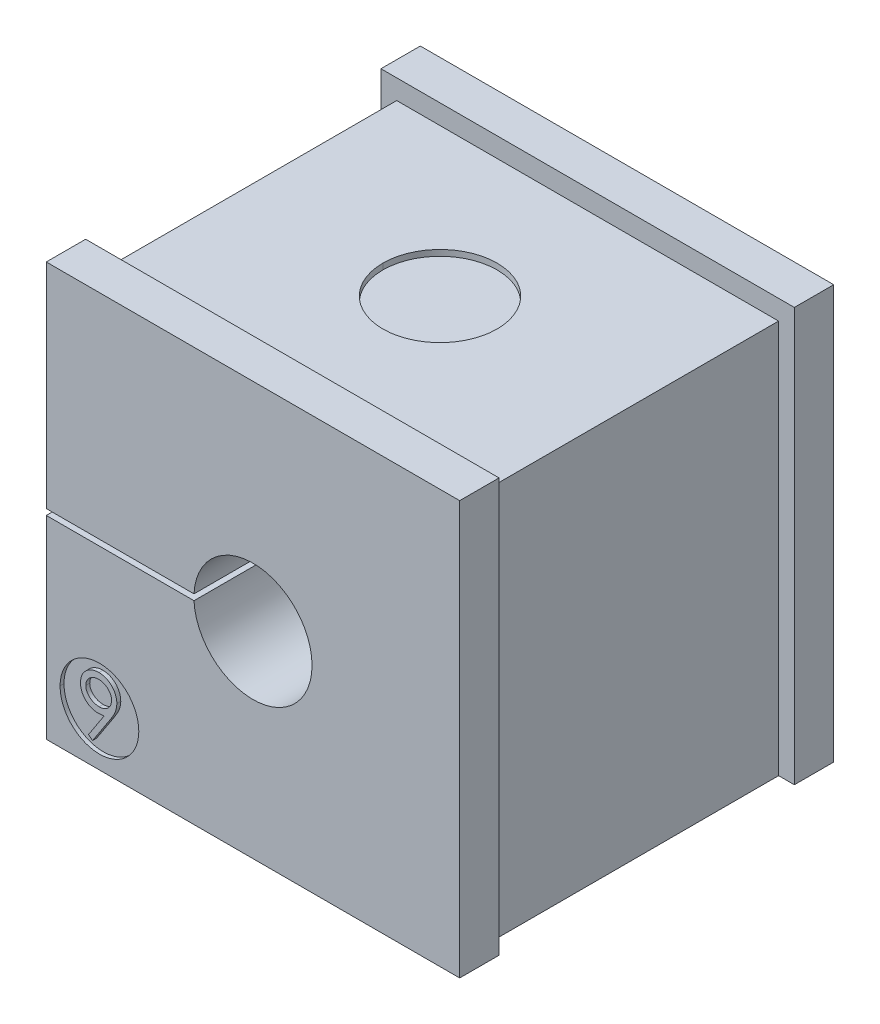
ISO-10303-21;
HEADER;
FILE_DESCRIPTION(('STEP AP214'),'2;1');
FILE_NAME('part.step','',(''),(''),'','','');
FILE_SCHEMA(('AUTOMOTIVE_DESIGN { 1 0 10303 214 1 1 1 1 }'));
ENDSEC;
DATA;
#1=APPLICATION_CONTEXT('core data for automotive mechanical design processes');
#2=APPLICATION_PROTOCOL_DEFINITION('international standard','automotive_design',2000,#1);
#3=PRODUCT_CONTEXT('',#1,'mechanical');
#4=PRODUCT('Part','Part','',(#3));
#5=PRODUCT_RELATED_PRODUCT_CATEGORY('part','',(#4));
#6=PRODUCT_DEFINITION_FORMATION('','',#4);
#7=PRODUCT_DEFINITION_CONTEXT('part definition',#1,'design');
#8=PRODUCT_DEFINITION('design','',#6,#7);
#9=PRODUCT_DEFINITION_SHAPE('','',#8);
#10=(LENGTH_UNIT() NAMED_UNIT(*) SI_UNIT(.MILLI.,.METRE.));
#11=(NAMED_UNIT(*) PLANE_ANGLE_UNIT() SI_UNIT($,.RADIAN.));
#12=(NAMED_UNIT(*) SI_UNIT($,.STERADIAN.) SOLID_ANGLE_UNIT());
#13=UNCERTAINTY_MEASURE_WITH_UNIT(LENGTH_MEASURE(1.E-05),#10,'distance_accuracy_value','');
#14=(GEOMETRIC_REPRESENTATION_CONTEXT(3) GLOBAL_UNCERTAINTY_ASSIGNED_CONTEXT((#13)) GLOBAL_UNIT_ASSIGNED_CONTEXT((#10,
#11,#12)) REPRESENTATION_CONTEXT('',''));
#15=CARTESIAN_POINT('',(0.,0.,0.));
#16=DIRECTION('',(0.,0.,1.));
#17=DIRECTION('',(1.,0.,0.));
#18=AXIS2_PLACEMENT_3D('',#15,#16,#17);
#19=CARTESIAN_POINT('',(1.73846153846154,-7.14194711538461,9.5));
#20=CARTESIAN_POINT('',(1.73846153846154,-7.14194711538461,9.3));
#21=CARTESIAN_POINT('',(1.74002419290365,-7.09998791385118,9.5));
#22=CARTESIAN_POINT('',(1.74002419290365,-7.09998791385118,9.3));
#23=CARTESIAN_POINT('',(1.74309731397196,-7.01747081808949,9.5));
#24=CARTESIAN_POINT('',(1.74309731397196,-7.01747081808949,9.3));
#25=CARTESIAN_POINT('',(1.76555243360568,-6.89680951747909,9.5));
#26=CARTESIAN_POINT('',(1.76555243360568,-6.89680951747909,9.3));
#27=CARTESIAN_POINT('',(1.80401924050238,-6.78284860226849,9.5));
#28=CARTESIAN_POINT('',(1.80401924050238,-6.78284860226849,9.3));
#29=CARTESIAN_POINT('',(1.85631036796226,-6.67529050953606,9.5));
#30=CARTESIAN_POINT('',(1.85631036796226,-6.67529050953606,9.3));
#31=CARTESIAN_POINT('',(1.92286214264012,-6.57638773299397,9.5));
#32=CARTESIAN_POINT('',(1.92286214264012,-6.57638773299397,9.3));
#33=CARTESIAN_POINT('',(2.00268597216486,-6.48730337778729,9.5));
#34=CARTESIAN_POINT('',(2.00268597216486,-6.48730337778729,9.3));
#35=CARTESIAN_POINT('',(2.09538775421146,-6.40965390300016,9.5));
#36=CARTESIAN_POINT('',(2.09538775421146,-6.40965390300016,9.3));
#37=CARTESIAN_POINT('',(2.19912174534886,-6.34307083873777,9.5));
#38=CARTESIAN_POINT('',(2.19912174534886,-6.34307083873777,9.3));
#39=CARTESIAN_POINT('',(2.31137897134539,-6.29016306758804,9.5));
#40=CARTESIAN_POINT('',(2.31137897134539,-6.29016306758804,9.3));
#41=CARTESIAN_POINT('',(2.42908834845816,-6.25104922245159,9.5));
#42=CARTESIAN_POINT('',(2.42908834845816,-6.25104922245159,9.3));
#43=CARTESIAN_POINT('',(2.55123889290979,-6.22767726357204,9.5));
#44=CARTESIAN_POINT('',(2.55123889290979,-6.22767726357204,9.3));
#45=CARTESIAN_POINT('',(2.63419609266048,-6.22461742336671,9.5));
#46=CARTESIAN_POINT('',(2.63419609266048,-6.22461742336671,9.3));
#47=CARTESIAN_POINT('',(2.67596153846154,-6.22307692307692,9.5));
#48=CARTESIAN_POINT('',(2.67596153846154,-6.22307692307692,9.3));
#49=B_SPLINE_SURFACE_WITH_KNOTS('',3,1,((#19,#20),(#21,#22),(#23,#24),(#25,#26),(#27,#28),(#29,
#30),(#31,#32),(#33,#34),(#35,#36),(#37,#38),(#39,#40),(#41,#42),(#43,#44),(#45,#46),(#47,#48)),
.UNSPECIFIED.,.F.,.F.,.F.,(4,1,1,1,1,1,1,1,1,1,1,1,4),(2,2),(0.,0.085992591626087,
0.169113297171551,0.250535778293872,0.331896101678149,0.413559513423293,0.494111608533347,
0.57629375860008,0.660702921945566,0.74611997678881,0.83001010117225,0.914417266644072,1.),(0.,
1.),.UNSPECIFIED.);
#50=CARTESIAN_POINT('',(2.67596153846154,-6.22307692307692,9.30000000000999));
#51=CARTESIAN_POINT('',(2.63419609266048,-6.22461742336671,9.30000000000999));
#52=CARTESIAN_POINT('',(2.55123889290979,-6.22767726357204,9.30000000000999));
#53=CARTESIAN_POINT('',(2.42908834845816,-6.25104922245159,9.30000000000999));
#54=CARTESIAN_POINT('',(2.31137897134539,-6.29016306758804,9.30000000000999));
#55=CARTESIAN_POINT('',(2.19912174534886,-6.34307083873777,9.30000000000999));
#56=CARTESIAN_POINT('',(2.09538775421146,-6.40965390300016,9.30000000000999));
#57=CARTESIAN_POINT('',(2.00268597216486,-6.48730337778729,9.30000000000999));
#58=CARTESIAN_POINT('',(1.92286214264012,-6.57638773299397,9.30000000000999));
#59=CARTESIAN_POINT('',(1.85631036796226,-6.67529050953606,9.30000000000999));
#60=CARTESIAN_POINT('',(1.80401924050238,-6.78284860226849,9.30000000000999));
#61=CARTESIAN_POINT('',(1.76555243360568,-6.89680951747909,9.30000000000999));
#62=CARTESIAN_POINT('',(1.74309731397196,-7.01747081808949,9.30000000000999));
#63=CARTESIAN_POINT('',(1.74002419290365,-7.09998791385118,9.30000000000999));
#64=CARTESIAN_POINT('',(1.73846153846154,-7.14194711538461,9.30000000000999));
#65=B_SPLINE_CURVE_WITH_KNOTS('',3,(#50,#51,#52,#53,#54,#55,#56,#57,#58,#59,#60,#61,#62,#63,
#64),.UNSPECIFIED.,.F.,.F.,(4,1,1,1,1,1,1,1,1,1,1,1,4),(0.,0.085582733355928,0.16998989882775,
0.25388002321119,0.339297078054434,0.42370624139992,0.505888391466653,0.586440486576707,
0.668103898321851,0.749464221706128,0.830886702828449,0.914007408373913,1.),.UNSPECIFIED.);
#66=CARTESIAN_POINT('',(1.73846153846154,-7.14194711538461,9.3));
#67=VERTEX_POINT('',#66);
#68=CARTESIAN_POINT('',(2.67596153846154,-6.22307692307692,9.3));
#69=VERTEX_POINT('',#68);
#70=EDGE_CURVE('E11',#67,#69,#65,.F.);
#71=DIRECTION('',(0.,0.,-1.));
#72=VECTOR('',#71,1.);
#73=CARTESIAN_POINT('',(1.73846153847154,-7.14194711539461,9.50000000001));
#74=LINE('',#73,#72);
#75=CARTESIAN_POINT('',(1.73846153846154,-7.14194711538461,9.5));
#76=VERTEX_POINT('',#75);
#77=EDGE_CURVE('E27',#76,#67,#74,.T.);
#78=CARTESIAN_POINT('',(1.73846153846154,-7.14194711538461,9.5));
#79=CARTESIAN_POINT('',(1.74002419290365,-7.09998791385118,9.5));
#80=CARTESIAN_POINT('',(1.74309731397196,-7.01747081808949,9.5));
#81=CARTESIAN_POINT('',(1.76555243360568,-6.89680951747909,9.5));
#82=CARTESIAN_POINT('',(1.80401924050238,-6.78284860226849,9.5));
#83=CARTESIAN_POINT('',(1.85631036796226,-6.67529050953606,9.5));
#84=CARTESIAN_POINT('',(1.92286214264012,-6.57638773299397,9.5));
#85=CARTESIAN_POINT('',(2.00268597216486,-6.48730337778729,9.5));
#86=CARTESIAN_POINT('',(2.09538775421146,-6.40965390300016,9.5));
#87=CARTESIAN_POINT('',(2.19912174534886,-6.34307083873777,9.5));
#88=CARTESIAN_POINT('',(2.31137897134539,-6.29016306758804,9.5));
#89=CARTESIAN_POINT('',(2.42908834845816,-6.25104922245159,9.5));
#90=CARTESIAN_POINT('',(2.55123889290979,-6.22767726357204,9.5));
#91=CARTESIAN_POINT('',(2.63419609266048,-6.22461742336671,9.5));
#92=CARTESIAN_POINT('',(2.67596153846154,-6.22307692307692,9.5));
#93=B_SPLINE_CURVE_WITH_KNOTS('',3,(#78,#79,#80,#81,#82,#83,#84,#85,#86,#87,#88,#89,#90,#91,
#92),.UNSPECIFIED.,.F.,.F.,(4,1,1,1,1,1,1,1,1,1,1,1,4),(0.,0.085992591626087,0.169113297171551,
0.250535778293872,0.331896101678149,0.413559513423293,0.494111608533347,0.57629375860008,
0.660702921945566,0.74611997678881,0.83001010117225,0.914417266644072,1.),.UNSPECIFIED.);
#94=CARTESIAN_POINT('',(2.67596153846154,-6.22307692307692,9.5));
#95=VERTEX_POINT('',#94);
#96=EDGE_CURVE('E648',#76,#95,#93,.T.);
#97=DIRECTION('',(0.,0.,-1.));
#98=VECTOR('',#97,1.);
#99=CARTESIAN_POINT('',(2.67596153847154,-6.22307692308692,9.50000000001));
#100=LINE('',#99,#98);
#101=EDGE_CURVE('E650',#95,#69,#100,.T.);
#102=ORIENTED_EDGE('',*,*,#70,.F.);
#103=ORIENTED_EDGE('',*,*,#77,.F.);
#104=ORIENTED_EDGE('',*,*,#96,.T.);
#105=ORIENTED_EDGE('',*,*,#101,.T.);
#106=EDGE_LOOP('',(#102,#103,#104,#105));
#107=FACE_BOUND('',#106,.T.);
#108=ADVANCED_FACE('F16',(#107),#49,.T.);
#109=CARTESIAN_POINT('',(2.67596153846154,-6.22307692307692,9.5));
#110=CARTESIAN_POINT('',(2.67596153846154,-6.22307692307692,9.3));
#111=CARTESIAN_POINT('',(2.71633184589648,-6.22438308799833,9.5));
#112=CARTESIAN_POINT('',(2.71633184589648,-6.22438308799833,9.3));
#113=CARTESIAN_POINT('',(2.79629835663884,-6.2269703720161,9.5));
#114=CARTESIAN_POINT('',(2.79629835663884,-6.2269703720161,9.3));
#115=CARTESIAN_POINT('',(2.91390150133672,-6.25013852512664,9.5));
#116=CARTESIAN_POINT('',(2.91390150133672,-6.25013852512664,9.3));
#117=CARTESIAN_POINT('',(3.02710443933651,-6.28742279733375,9.5));
#118=CARTESIAN_POINT('',(3.02710443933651,-6.28742279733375,9.3));
#119=CARTESIAN_POINT('',(3.13445144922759,-6.33986656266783,9.5));
#120=CARTESIAN_POINT('',(3.13445144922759,-6.33986656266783,9.3));
#121=CARTESIAN_POINT('',(3.2340648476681,-6.40498730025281,9.5));
#122=CARTESIAN_POINT('',(3.2340648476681,-6.40498730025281,9.3));
#123=CARTESIAN_POINT('',(3.3238683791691,-6.48285019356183,9.5));
#124=CARTESIAN_POINT('',(3.3238683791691,-6.48285019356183,9.3));
#125=CARTESIAN_POINT('',(3.40158969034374,-6.57350574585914,9.5));
#126=CARTESIAN_POINT('',(3.40158969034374,-6.57350574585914,9.3));
#127=CARTESIAN_POINT('',(3.46650646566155,-6.67526229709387,9.5));
#128=CARTESIAN_POINT('',(3.46650646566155,-6.67526229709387,9.3));
#129=CARTESIAN_POINT('',(3.51963017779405,-6.78374404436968,9.5));
#130=CARTESIAN_POINT('',(3.51963017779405,-6.78374404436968,9.3));
#131=CARTESIAN_POINT('',(3.55674849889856,-6.89809030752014,9.5));
#132=CARTESIAN_POINT('',(3.55674849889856,-6.89809030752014,9.3));
#133=CARTESIAN_POINT('',(3.58088177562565,-7.01593129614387,9.5));
#134=CARTESIAN_POINT('',(3.58088177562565,-7.01593129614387,9.3));
#135=CARTESIAN_POINT('',(3.58336528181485,-7.09615625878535,9.5));
#136=CARTESIAN_POINT('',(3.58336528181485,-7.09615625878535,9.3));
#137=CARTESIAN_POINT('',(3.58461538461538,-7.13653846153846,9.5));
#138=CARTESIAN_POINT('',(3.58461538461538,-7.13653846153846,9.3));
#139=B_SPLINE_SURFACE_WITH_KNOTS('',3,1,((#109,#110),(#111,#112),(#113,#114),(#115,#116),(#117,
#118),(#119,#120),(#121,#122),(#123,#124),(#125,#126),(#127,#128),(#129,#130),(#131,#132),(#133,
#134),(#135,#136),(#137,#138)),.UNSPECIFIED.,.F.,.F.,.F.,(4,1,1,1,1,1,1,1,1,1,1,1,4),(2,2),(0.,
0.0843391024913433,0.167060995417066,0.249579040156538,0.332940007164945,0.416118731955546,
0.497760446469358,0.580626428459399,0.664858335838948,0.749532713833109,0.832448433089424,
0.915660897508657,1.),(0.,1.),.UNSPECIFIED.);
#140=CARTESIAN_POINT('',(3.58461538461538,-7.13653846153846,9.30000000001));
#141=CARTESIAN_POINT('',(3.58336528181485,-7.09615625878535,9.30000000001));
#142=CARTESIAN_POINT('',(3.58088177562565,-7.01593129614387,9.30000000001));
#143=CARTESIAN_POINT('',(3.55674849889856,-6.89809030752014,9.30000000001));
#144=CARTESIAN_POINT('',(3.51963017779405,-6.78374404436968,9.30000000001));
#145=CARTESIAN_POINT('',(3.46650646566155,-6.67526229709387,9.30000000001));
#146=CARTESIAN_POINT('',(3.40158969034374,-6.57350574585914,9.30000000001));
#147=CARTESIAN_POINT('',(3.3238683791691,-6.48285019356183,9.30000000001));
#148=CARTESIAN_POINT('',(3.2340648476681,-6.40498730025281,9.30000000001));
#149=CARTESIAN_POINT('',(3.13445144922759,-6.33986656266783,9.30000000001));
#150=CARTESIAN_POINT('',(3.02710443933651,-6.28742279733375,9.30000000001));
#151=CARTESIAN_POINT('',(2.91390150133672,-6.25013852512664,9.30000000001));
#152=CARTESIAN_POINT('',(2.79629835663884,-6.2269703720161,9.30000000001));
#153=CARTESIAN_POINT('',(2.71633184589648,-6.22438308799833,9.30000000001));
#154=CARTESIAN_POINT('',(2.67596153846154,-6.22307692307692,9.30000000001));
#155=B_SPLINE_CURVE_WITH_KNOTS('',3,(#140,#141,#142,#143,#144,#145,#146,#147,#148,#149,#150,
#151,#152,#153,#154),.UNSPECIFIED.,.F.,.F.,(4,1,1,1,1,1,1,1,1,1,1,1,4),(0.,0.084339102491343,
0.167551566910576,0.250467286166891,0.335141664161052,0.419373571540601,0.502239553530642,
0.583881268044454,0.667059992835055,0.750420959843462,0.832939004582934,0.915660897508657,1.),.UNSPECIFIED.);
#156=CARTESIAN_POINT('',(3.58461538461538,-7.13653846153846,9.3));
#157=VERTEX_POINT('',#156);
#158=EDGE_CURVE('E674',#69,#157,#155,.F.);
#159=CARTESIAN_POINT('',(2.67596153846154,-6.22307692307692,9.5));
#160=CARTESIAN_POINT('',(2.71633184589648,-6.22438308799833,9.5));
#161=CARTESIAN_POINT('',(2.79629835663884,-6.2269703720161,9.5));
#162=CARTESIAN_POINT('',(2.91390150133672,-6.25013852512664,9.5));
#163=CARTESIAN_POINT('',(3.02710443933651,-6.28742279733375,9.5));
#164=CARTESIAN_POINT('',(3.13445144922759,-6.33986656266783,9.5));
#165=CARTESIAN_POINT('',(3.2340648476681,-6.40498730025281,9.5));
#166=CARTESIAN_POINT('',(3.3238683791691,-6.48285019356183,9.5));
#167=CARTESIAN_POINT('',(3.40158969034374,-6.57350574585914,9.5));
#168=CARTESIAN_POINT('',(3.46650646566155,-6.67526229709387,9.5));
#169=CARTESIAN_POINT('',(3.51963017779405,-6.78374404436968,9.5));
#170=CARTESIAN_POINT('',(3.55674849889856,-6.89809030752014,9.5));
#171=CARTESIAN_POINT('',(3.58088177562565,-7.01593129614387,9.5));
#172=CARTESIAN_POINT('',(3.58336528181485,-7.09615625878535,9.5));
#173=CARTESIAN_POINT('',(3.58461538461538,-7.13653846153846,9.5));
#174=B_SPLINE_CURVE_WITH_KNOTS('',3,(#159,#160,#161,#162,#163,#164,#165,#166,#167,#168,#169,
#170,#171,#172,#173),.UNSPECIFIED.,.F.,.F.,(4,1,1,1,1,1,1,1,1,1,1,1,4),(0.,0.0843391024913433,
0.167060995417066,0.249579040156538,0.332940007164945,0.416118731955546,0.497760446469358,
0.580626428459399,0.664858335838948,0.749532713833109,0.832448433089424,0.915660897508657,1.),.UNSPECIFIED.);
#175=CARTESIAN_POINT('',(3.58461538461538,-7.13653846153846,9.5));
#176=VERTEX_POINT('',#175);
#177=EDGE_CURVE('E717',#95,#176,#174,.T.);
#178=DIRECTION('',(0.,0.,-1.));
#179=VECTOR('',#178,1.);
#180=CARTESIAN_POINT('',(3.58461538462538,-7.13653846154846,9.50000000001));
#181=LINE('',#180,#179);
#182=EDGE_CURVE('E715',#176,#157,#181,.T.);
#183=ORIENTED_EDGE('',*,*,#158,.F.);
#184=ORIENTED_EDGE('',*,*,#101,.F.);
#185=ORIENTED_EDGE('',*,*,#177,.T.);
#186=ORIENTED_EDGE('',*,*,#182,.T.);
#187=EDGE_LOOP('',(#183,#184,#185,#186));
#188=FACE_BOUND('',#187,.T.);
#189=ADVANCED_FACE('F683',(#188),#139,.T.);
#190=CARTESIAN_POINT('',(3.58461538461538,-7.13653846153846,9.5));
#191=CARTESIAN_POINT('',(3.58461538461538,-7.13653846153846,9.3));
#192=CARTESIAN_POINT('',(3.58352814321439,-7.16742256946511,9.5));
#193=CARTESIAN_POINT('',(3.58352814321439,-7.16742256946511,9.3));
#194=CARTESIAN_POINT('',(3.581309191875,-7.23045395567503,9.5));
#195=CARTESIAN_POINT('',(3.581309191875,-7.23045395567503,9.3));
#196=CARTESIAN_POINT('',(3.568066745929,-7.32619290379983,9.5));
#197=CARTESIAN_POINT('',(3.568066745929,-7.32619290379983,9.3));
#198=CARTESIAN_POINT('',(3.54377848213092,-7.42377053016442,9.5));
#199=CARTESIAN_POINT('',(3.54377848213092,-7.42377053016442,9.3));
#200=CARTESIAN_POINT('',(3.51749327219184,-7.50648966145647,9.5));
#201=CARTESIAN_POINT('',(3.51749327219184,-7.50648966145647,9.3));
#202=CARTESIAN_POINT('',(3.49141040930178,-7.57499608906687,9.5));
#203=CARTESIAN_POINT('',(3.49141040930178,-7.57499608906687,9.3));
#204=CARTESIAN_POINT('',(3.46722577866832,-7.62909380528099,9.5));
#205=CARTESIAN_POINT('',(3.46722577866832,-7.62909380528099,9.3));
#206=CARTESIAN_POINT('',(3.44018441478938,-7.68622273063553,9.5));
#207=CARTESIAN_POINT('',(3.44018441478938,-7.68622273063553,9.3));
#208=CARTESIAN_POINT('',(3.40848817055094,-7.74530192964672,9.5));
#209=CARTESIAN_POINT('',(3.40848817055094,-7.74530192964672,9.3));
#210=CARTESIAN_POINT('',(3.37488759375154,-7.80801942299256,9.5));
#211=CARTESIAN_POINT('',(3.37488759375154,-7.80801942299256,9.3));
#212=CARTESIAN_POINT('',(3.33563830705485,-7.87205259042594,9.5));
#213=CARTESIAN_POINT('',(3.33563830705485,-7.87205259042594,9.3));
#214=CARTESIAN_POINT('',(3.29468107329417,-7.9397401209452,9.5));
#215=CARTESIAN_POINT('',(3.29468107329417,-7.9397401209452,9.3));
#216=CARTESIAN_POINT('',(3.26467684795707,-7.98480542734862,9.5));
#217=CARTESIAN_POINT('',(3.26467684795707,-7.98480542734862,9.3));
#218=CARTESIAN_POINT('',(3.24927884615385,-8.00793269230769,9.5));
#219=CARTESIAN_POINT('',(3.24927884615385,-8.00793269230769,9.3));
#220=B_SPLINE_SURFACE_WITH_KNOTS('',3,1,((#190,#191),(#192,#193),(#194,#195),(#196,#197),(#198,
#199),(#200,#201),(#202,#203),(#204,#205),(#206,#207),(#208,#209),(#210,#211),(#212,#213),(#214,
#215),(#216,#217),(#218,#219)),.UNSPECIFIED.,.F.,.F.,.F.,(4,1,1,1,1,1,1,1,1,1,1,1,4),(2,2),(0.,
0.0978059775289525,0.199612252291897,0.305296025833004,0.415817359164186,0.474240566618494,
0.537286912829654,0.603385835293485,0.674311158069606,0.749530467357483,0.828608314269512,
0.912042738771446,1.),(0.,1.),.UNSPECIFIED.);
#221=CARTESIAN_POINT('',(3.24927884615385,-8.00793269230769,9.30000000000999));
#222=CARTESIAN_POINT('',(3.26467684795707,-7.98480542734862,9.30000000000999));
#223=CARTESIAN_POINT('',(3.29468107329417,-7.9397401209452,9.30000000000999));
#224=CARTESIAN_POINT('',(3.33563830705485,-7.87205259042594,9.30000000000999));
#225=CARTESIAN_POINT('',(3.37488759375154,-7.80801942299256,9.30000000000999));
#226=CARTESIAN_POINT('',(3.40848817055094,-7.74530192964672,9.30000000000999));
#227=CARTESIAN_POINT('',(3.44018441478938,-7.68622273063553,9.30000000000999));
#228=CARTESIAN_POINT('',(3.46722577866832,-7.62909380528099,9.30000000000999));
#229=CARTESIAN_POINT('',(3.49141040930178,-7.57499608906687,9.30000000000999));
#230=CARTESIAN_POINT('',(3.51749327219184,-7.50648966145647,9.30000000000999));
#231=CARTESIAN_POINT('',(3.54377848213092,-7.42377053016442,9.30000000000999));
#232=CARTESIAN_POINT('',(3.568066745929,-7.32619290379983,9.30000000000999));
#233=CARTESIAN_POINT('',(3.581309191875,-7.23045395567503,9.30000000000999));
#234=CARTESIAN_POINT('',(3.58352814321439,-7.16742256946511,9.30000000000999));
#235=CARTESIAN_POINT('',(3.58461538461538,-7.13653846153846,9.30000000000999));
#236=B_SPLINE_CURVE_WITH_KNOTS('',3,(#221,#222,#223,#224,#225,#226,#227,#228,#229,#230,#231,
#232,#233,#234,#235),.UNSPECIFIED.,.F.,.F.,(4,1,1,1,1,1,1,1,1,1,1,1,4),(0.,0.087957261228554,
0.171391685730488,0.250469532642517,0.325688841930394,0.396614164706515,0.462713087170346,
0.525759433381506,0.584182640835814,0.694703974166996,0.800387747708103,0.902194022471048,1.),.UNSPECIFIED.);
#237=CARTESIAN_POINT('',(3.24927884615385,-8.00793269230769,9.3));
#238=VERTEX_POINT('',#237);
#239=EDGE_CURVE('E718',#157,#238,#236,.F.);
#240=CARTESIAN_POINT('',(3.58461538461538,-7.13653846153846,9.5));
#241=CARTESIAN_POINT('',(3.58352814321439,-7.16742256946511,9.5));
#242=CARTESIAN_POINT('',(3.581309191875,-7.23045395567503,9.5));
#243=CARTESIAN_POINT('',(3.568066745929,-7.32619290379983,9.5));
#244=CARTESIAN_POINT('',(3.54377848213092,-7.42377053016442,9.5));
#245=CARTESIAN_POINT('',(3.51749327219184,-7.50648966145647,9.5));
#246=CARTESIAN_POINT('',(3.49141040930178,-7.57499608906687,9.5));
#247=CARTESIAN_POINT('',(3.46722577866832,-7.62909380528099,9.5));
#248=CARTESIAN_POINT('',(3.44018441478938,-7.68622273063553,9.5));
#249=CARTESIAN_POINT('',(3.40848817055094,-7.74530192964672,9.5));
#250=CARTESIAN_POINT('',(3.37488759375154,-7.80801942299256,9.5));
#251=CARTESIAN_POINT('',(3.33563830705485,-7.87205259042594,9.5));
#252=CARTESIAN_POINT('',(3.29468107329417,-7.9397401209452,9.5));
#253=CARTESIAN_POINT('',(3.26467684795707,-7.98480542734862,9.5));
#254=CARTESIAN_POINT('',(3.24927884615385,-8.00793269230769,9.5));
#255=B_SPLINE_CURVE_WITH_KNOTS('',3,(#240,#241,#242,#243,#244,#245,#246,#247,#248,#249,#250,
#251,#252,#253,#254),.UNSPECIFIED.,.F.,.F.,(4,1,1,1,1,1,1,1,1,1,1,1,4),(0.,0.0978059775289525,
0.199612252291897,0.305296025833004,0.415817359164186,0.474240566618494,0.537286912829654,
0.603385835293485,0.674311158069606,0.749530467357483,0.828608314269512,0.912042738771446,1.),.UNSPECIFIED.);
#256=CARTESIAN_POINT('',(3.24927884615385,-8.00793269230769,9.5));
#257=VERTEX_POINT('',#256);
#258=EDGE_CURVE('E733',#176,#257,#255,.T.);
#259=DIRECTION('',(0.,0.,-1.));
#260=VECTOR('',#259,1.);
#261=CARTESIAN_POINT('',(3.24927884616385,-8.00793269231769,9.50000000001));
#262=LINE('',#261,#260);
#263=EDGE_CURVE('E745',#257,#238,#262,.T.);
#264=ORIENTED_EDGE('',*,*,#239,.F.);
#265=ORIENTED_EDGE('',*,*,#182,.F.);
#266=ORIENTED_EDGE('',*,*,#258,.T.);
#267=ORIENTED_EDGE('',*,*,#263,.T.);
#268=EDGE_LOOP('',(#264,#265,#266,#267));
#269=FACE_BOUND('',#268,.T.);
#270=ADVANCED_FACE('F694',(#269),#220,.T.);
#271=CARTESIAN_POINT('',(3.24927884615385,-8.00793269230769,9.5));
#272=DIRECTION('',(0.836878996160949,-0.547387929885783,0.));
#273=DIRECTION('',(0.,0.,-1.));
#274=AXIS2_PLACEMENT_3D('',#271,#272,#273);
#275=PLANE('',#274);
#276=DIRECTION('',(-0.547387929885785,-0.836878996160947,0.));
#277=VECTOR('',#276,1.);
#278=CARTESIAN_POINT('',(3.24927884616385,-8.00793269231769,9.30000000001));
#279=LINE('',#278,#277);
#280=CARTESIAN_POINT('',(2.35384615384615,-9.37692307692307,9.3));
#281=VERTEX_POINT('',#280);
#282=EDGE_CURVE('E747',#238,#281,#279,.T.);
#283=ORIENTED_EDGE('',*,*,#282,.F.);
#284=ORIENTED_EDGE('',*,*,#263,.F.);
#285=DIRECTION('',(-0.547387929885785,-0.836878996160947,0.));
#286=VECTOR('',#285,1.);
#287=CARTESIAN_POINT('',(3.24927884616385,-8.00793269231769,9.50000000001));
#288=LINE('',#287,#286);
#289=CARTESIAN_POINT('',(2.35384615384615,-9.37692307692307,9.5));
#290=VERTEX_POINT('',#289);
#291=EDGE_CURVE('E751',#257,#290,#288,.T.);
#292=ORIENTED_EDGE('',*,*,#291,.T.);
#293=DIRECTION('',(0.,0.,-1.));
#294=VECTOR('',#293,1.);
#295=CARTESIAN_POINT('',(2.35384615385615,-9.37692307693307,9.50000000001));
#296=LINE('',#295,#294);
#297=EDGE_CURVE('E755',#290,#281,#296,.T.);
#298=ORIENTED_EDGE('',*,*,#297,.T.);
#299=EDGE_LOOP('',(#283,#284,#292,#298));
#300=FACE_BOUND('',#299,.T.);
#301=ADVANCED_FACE('F935',(#300),#275,.T.);
#302=CARTESIAN_POINT('',(2.35384615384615,-9.37692307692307,9.5));
#303=DIRECTION('',(-0.617720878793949,-0.786397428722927,0.));
#304=DIRECTION('',(-0.786397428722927,0.617720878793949,0.));
#305=AXIS2_PLACEMENT_3D('',#302,#303,#304);
#306=PLANE('',#305);
#307=DIRECTION('',(-0.786397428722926,0.61772087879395,0.));
#308=VECTOR('',#307,1.);
#309=CARTESIAN_POINT('',(2.35384615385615,-9.37692307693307,9.30000000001));
#310=LINE('',#309,#308);
#311=CARTESIAN_POINT('',(2.14651442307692,-9.2140625,9.3));
#312=VERTEX_POINT('',#311);
#313=EDGE_CURVE('E759',#281,#312,#310,.T.);
#314=ORIENTED_EDGE('',*,*,#313,.F.);
#315=ORIENTED_EDGE('',*,*,#297,.F.);
#316=DIRECTION('',(-0.786397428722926,0.61772087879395,0.));
#317=VECTOR('',#316,1.);
#318=CARTESIAN_POINT('',(2.35384615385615,-9.37692307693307,9.50000000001));
#319=LINE('',#318,#317);
#320=CARTESIAN_POINT('',(2.14651442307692,-9.2140625,9.5));
#321=VERTEX_POINT('',#320);
#322=EDGE_CURVE('E764',#290,#321,#319,.T.);
#323=ORIENTED_EDGE('',*,*,#322,.T.);
#324=DIRECTION('',(0.,0.,-1.));
#325=VECTOR('',#324,1.);
#326=CARTESIAN_POINT('',(2.14651442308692,-9.21406250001,9.50000000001));
#327=LINE('',#326,#325);
#328=EDGE_CURVE('E768',#321,#312,#327,.T.);
#329=ORIENTED_EDGE('',*,*,#328,.T.);
#330=EDGE_LOOP('',(#314,#315,#323,#329));
#331=FACE_BOUND('',#330,.T.);
#332=ADVANCED_FACE('F942',(#331),#306,.T.);
#333=CARTESIAN_POINT('',(2.14651442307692,-9.2140625,9.5));
#334=DIRECTION('',(-0.836933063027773,0.547305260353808,0.));
#335=DIRECTION('',(0.,0.,1.));
#336=AXIS2_PLACEMENT_3D('',#333,#334,#335);
#337=PLANE('',#336);
#338=DIRECTION('',(0.547305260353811,0.836933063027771,0.));
#339=VECTOR('',#338,1.);
#340=CARTESIAN_POINT('',(2.14651442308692,-9.21406250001,9.30000000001));
#341=LINE('',#340,#339);
#342=CARTESIAN_POINT('',(2.93918269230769,-8.00192307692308,9.3));
#343=VERTEX_POINT('',#342);
#344=EDGE_CURVE('E772',#312,#343,#341,.T.);
#345=ORIENTED_EDGE('',*,*,#344,.F.);
#346=ORIENTED_EDGE('',*,*,#328,.F.);
#347=DIRECTION('',(0.547305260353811,0.836933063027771,0.));
#348=VECTOR('',#347,1.);
#349=CARTESIAN_POINT('',(2.14651442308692,-9.21406250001,9.50000000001));
#350=LINE('',#349,#348);
#351=CARTESIAN_POINT('',(2.93918269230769,-8.00192307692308,9.5));
#352=VERTEX_POINT('',#351);
#353=EDGE_CURVE('E776',#321,#352,#350,.T.);
#354=ORIENTED_EDGE('',*,*,#353,.T.);
#355=DIRECTION('',(0.,0.,-1.));
#356=VECTOR('',#355,1.);
#357=CARTESIAN_POINT('',(2.93918269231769,-8.00192307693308,9.50000000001));
#358=LINE('',#357,#356);
#359=EDGE_CURVE('E780',#352,#343,#358,.T.);
#360=ORIENTED_EDGE('',*,*,#359,.T.);
#361=EDGE_LOOP('',(#345,#346,#354,#360));
#362=FACE_BOUND('',#361,.T.);
#363=ADVANCED_FACE('F804',(#362),#337,.T.);
#364=CARTESIAN_POINT('',(2.93918269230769,-8.00192307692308,9.5));
#365=CARTESIAN_POINT('',(2.93918269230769,-8.00192307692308,9.3));
#366=CARTESIAN_POINT('',(2.88640816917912,-8.0103349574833,9.5));
#367=CARTESIAN_POINT('',(2.88640816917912,-8.0103349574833,9.3));
#368=CARTESIAN_POINT('',(2.78346549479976,-8.02674328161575,9.5));
#369=CARTESIAN_POINT('',(2.78346549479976,-8.02674328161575,9.3));
#370=CARTESIAN_POINT('',(2.67926615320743,-8.02945009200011,9.5));
#371=CARTESIAN_POINT('',(2.67926615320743,-8.02945009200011,9.3));
#372=CARTESIAN_POINT('',(2.62848557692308,-8.03076923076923,9.5));
#373=CARTESIAN_POINT('',(2.62848557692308,-8.03076923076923,9.3));
#374=B_SPLINE_SURFACE_WITH_KNOTS('',3,1,((#364,#365),(#366,#367),(#368,#369),(#370,#371),(#372,
#373)),.UNSPECIFIED.,.F.,.F.,.F.,(4,1,4),(2,2),(0.,0.512659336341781,1.),(0.,1.),.UNSPECIFIED.);
#375=CARTESIAN_POINT('',(2.62848557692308,-8.03076923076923,9.30000000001));
#376=CARTESIAN_POINT('',(2.67926615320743,-8.02945009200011,9.30000000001));
#377=CARTESIAN_POINT('',(2.78346549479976,-8.02674328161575,9.30000000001));
#378=CARTESIAN_POINT('',(2.88640816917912,-8.0103349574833,9.30000000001));
#379=CARTESIAN_POINT('',(2.93918269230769,-8.00192307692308,9.30000000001));
#380=B_SPLINE_CURVE_WITH_KNOTS('',3,(#375,#376,#377,#378,#379),.UNSPECIFIED.,.F.,.F.,(4,1,4),
(0.,0.487340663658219,1.),.UNSPECIFIED.);
#381=CARTESIAN_POINT('',(2.62848557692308,-8.03076923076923,9.3));
#382=VERTEX_POINT('',#381);
#383=EDGE_CURVE('E638',#343,#382,#380,.F.);
#384=CARTESIAN_POINT('',(2.93918269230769,-8.00192307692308,9.5));
#385=CARTESIAN_POINT('',(2.88640816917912,-8.0103349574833,9.5));
#386=CARTESIAN_POINT('',(2.78346549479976,-8.02674328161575,9.5));
#387=CARTESIAN_POINT('',(2.67926615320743,-8.02945009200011,9.5));
#388=CARTESIAN_POINT('',(2.62848557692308,-8.03076923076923,9.5));
#389=B_SPLINE_CURVE_WITH_KNOTS('',3,(#384,#385,#386,#387,#388),.UNSPECIFIED.,.F.,.F.,(4,1,4),
(0.,0.512659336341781,1.),.UNSPECIFIED.);
#390=CARTESIAN_POINT('',(2.62848557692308,-8.03076923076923,9.5));
#391=VERTEX_POINT('',#390);
#392=EDGE_CURVE('E826',#352,#391,#389,.T.);
#393=DIRECTION('',(0.,0.,-1.));
#394=VECTOR('',#393,1.);
#395=CARTESIAN_POINT('',(2.62848557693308,-8.03076923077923,9.50000000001));
#396=LINE('',#395,#394);
#397=EDGE_CURVE('E642',#391,#382,#396,.T.);
#398=ORIENTED_EDGE('',*,*,#383,.F.);
#399=ORIENTED_EDGE('',*,*,#359,.F.);
#400=ORIENTED_EDGE('',*,*,#392,.T.);
#401=ORIENTED_EDGE('',*,*,#397,.T.);
#402=EDGE_LOOP('',(#398,#399,#400,#401));
#403=FACE_BOUND('',#402,.T.);
#404=ADVANCED_FACE('F792',(#403),#374,.T.);
#405=CARTESIAN_POINT('',(2.62848557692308,-8.03076923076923,9.5));
#406=CARTESIAN_POINT('',(2.62848557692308,-8.03076923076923,9.3));
#407=CARTESIAN_POINT('',(2.5979948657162,-8.02994970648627,9.5));
#408=CARTESIAN_POINT('',(2.5979948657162,-8.02994970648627,9.3));
#409=CARTESIAN_POINT('',(2.5379748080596,-8.02833649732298,9.5));
#410=CARTESIAN_POINT('',(2.5379748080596,-8.02833649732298,9.3));
#411=CARTESIAN_POINT('',(2.44985469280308,-8.01592176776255,9.5));
#412=CARTESIAN_POINT('',(2.44985469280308,-8.01592176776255,9.3));
#413=CARTESIAN_POINT('',(2.36517845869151,-7.99635738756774,9.5));
#414=CARTESIAN_POINT('',(2.36517845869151,-7.99635738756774,9.3));
#415=CARTESIAN_POINT('',(2.28429708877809,-7.96783830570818,9.5));
#416=CARTESIAN_POINT('',(2.28429708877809,-7.96783830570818,9.3));
#417=CARTESIAN_POINT('',(2.20692020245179,-7.93140773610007,9.5));
#418=CARTESIAN_POINT('',(2.20692020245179,-7.93140773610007,9.3));
#419=CARTESIAN_POINT('',(2.13260403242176,-7.88774577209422,9.5));
#420=CARTESIAN_POINT('',(2.13260403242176,-7.88774577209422,9.3));
#421=CARTESIAN_POINT('',(2.06274451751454,-7.83459833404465,9.5));
#422=CARTESIAN_POINT('',(2.06274451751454,-7.83459833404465,9.3));
#423=CARTESIAN_POINT('',(1.99644600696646,-7.77522726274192,9.5));
#424=CARTESIAN_POINT('',(1.99644600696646,-7.77522726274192,9.3));
#425=CARTESIAN_POINT('',(1.936242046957,-7.70947397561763,9.5));
#426=CARTESIAN_POINT('',(1.936242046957,-7.70947397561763,9.3));
#427=CARTESIAN_POINT('',(1.88298193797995,-7.6396864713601,9.5));
#428=CARTESIAN_POINT('',(1.88298193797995,-7.6396864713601,9.3));
#429=CARTESIAN_POINT('',(1.83799932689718,-7.56587026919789,9.5));
#430=CARTESIAN_POINT('',(1.83799932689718,-7.56587026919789,9.3));
#431=CARTESIAN_POINT('',(1.80216143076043,-7.4880419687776,9.5));
#432=CARTESIAN_POINT('',(1.80216143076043,-7.4880419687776,9.3));
#433=CARTESIAN_POINT('',(1.77352060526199,-7.40681079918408,9.5));
#434=CARTESIAN_POINT('',(1.77352060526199,-7.40681079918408,9.3));
#435=CARTESIAN_POINT('',(1.75313182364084,-7.32185995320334,9.5));
#436=CARTESIAN_POINT('',(1.75313182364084,-7.32185995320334,9.3));
#437=CARTESIAN_POINT('',(1.74094310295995,-7.23304605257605,9.5));
#438=CARTESIAN_POINT('',(1.74094310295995,-7.23304605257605,9.3));
#439=CARTESIAN_POINT('',(1.73929746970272,-7.1726343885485,9.5));
#440=CARTESIAN_POINT('',(1.73929746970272,-7.1726343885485,9.3));
#441=CARTESIAN_POINT('',(1.73846153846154,-7.14194711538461,9.5));
#442=CARTESIAN_POINT('',(1.73846153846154,-7.14194711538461,9.3));
#443=B_SPLINE_SURFACE_WITH_KNOTS('',3,1,((#405,#406),(#407,#408),(#409,#410),(#411,#412),(#413,
#414),(#415,#416),(#417,#418),(#419,#420),(#421,#422),(#423,#424),(#425,#426),(#427,#428),(#429,
#430),(#431,#432),(#433,#434),(#435,#436),(#437,#438),(#439,#440),(#441,#442)),.UNSPECIFIED.,
.F.,.F.,.F.,(4,1,1,1,1,1,1,1,1,1,1,1,1,1,1,1,4),(2,2),(0.,0.0652318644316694,0.128406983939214,
0.190070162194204,0.250947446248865,0.311550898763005,0.372868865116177,0.4350307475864,
0.499079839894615,0.563100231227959,0.625520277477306,0.686691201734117,0.747683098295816,
0.808560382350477,0.870740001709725,0.934339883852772,1.),(0.,1.),.UNSPECIFIED.);
#444=CARTESIAN_POINT('',(1.73846153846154,-7.14194711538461,9.30000000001));
#445=CARTESIAN_POINT('',(1.73929746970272,-7.1726343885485,9.30000000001));
#446=CARTESIAN_POINT('',(1.74094310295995,-7.23304605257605,9.30000000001));
#447=CARTESIAN_POINT('',(1.75313182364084,-7.32185995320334,9.30000000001));
#448=CARTESIAN_POINT('',(1.77352060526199,-7.40681079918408,9.30000000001));
#449=CARTESIAN_POINT('',(1.80216143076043,-7.4880419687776,9.30000000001));
#450=CARTESIAN_POINT('',(1.83799932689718,-7.56587026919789,9.30000000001));
#451=CARTESIAN_POINT('',(1.88298193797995,-7.6396864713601,9.30000000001));
#452=CARTESIAN_POINT('',(1.936242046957,-7.70947397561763,9.30000000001));
#453=CARTESIAN_POINT('',(1.99644600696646,-7.77522726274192,9.30000000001));
#454=CARTESIAN_POINT('',(2.06274451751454,-7.83459833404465,9.30000000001));
#455=CARTESIAN_POINT('',(2.13260403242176,-7.88774577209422,9.30000000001));
#456=CARTESIAN_POINT('',(2.20692020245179,-7.93140773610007,9.30000000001));
#457=CARTESIAN_POINT('',(2.28429708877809,-7.96783830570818,9.30000000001));
#458=CARTESIAN_POINT('',(2.36517845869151,-7.99635738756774,9.30000000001));
#459=CARTESIAN_POINT('',(2.44985469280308,-8.01592176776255,9.30000000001));
#460=CARTESIAN_POINT('',(2.5379748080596,-8.02833649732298,9.30000000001));
#461=CARTESIAN_POINT('',(2.5979948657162,-8.02994970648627,9.30000000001));
#462=CARTESIAN_POINT('',(2.62848557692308,-8.03076923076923,9.30000000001));
#463=B_SPLINE_CURVE_WITH_KNOTS('',3,(#444,#445,#446,#447,#448,#449,#450,#451,#452,#453,#454,
#455,#456,#457,#458,#459,#460,#461,#462),.UNSPECIFIED.,.F.,.F.,(4,1,1,1,1,1,1,1,1,1,1,1,1,1,1,1,
4),(0.,0.065660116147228,0.129259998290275,0.191439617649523,0.252316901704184,
0.313308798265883,0.374479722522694,0.436899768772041,0.500920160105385,0.5649692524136,
0.627131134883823,0.688449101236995,0.749052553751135,0.809929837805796,0.871593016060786,
0.934768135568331,1.),.UNSPECIFIED.);
#464=EDGE_CURVE('E634',#382,#67,#463,.F.);
#465=CARTESIAN_POINT('',(2.62848557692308,-8.03076923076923,9.5));
#466=CARTESIAN_POINT('',(2.5979948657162,-8.02994970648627,9.5));
#467=CARTESIAN_POINT('',(2.5379748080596,-8.02833649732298,9.5));
#468=CARTESIAN_POINT('',(2.44985469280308,-8.01592176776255,9.5));
#469=CARTESIAN_POINT('',(2.36517845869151,-7.99635738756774,9.5));
#470=CARTESIAN_POINT('',(2.28429708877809,-7.96783830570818,9.5));
#471=CARTESIAN_POINT('',(2.20692020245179,-7.93140773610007,9.5));
#472=CARTESIAN_POINT('',(2.13260403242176,-7.88774577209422,9.5));
#473=CARTESIAN_POINT('',(2.06274451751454,-7.83459833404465,9.5));
#474=CARTESIAN_POINT('',(1.99644600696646,-7.77522726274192,9.5));
#475=CARTESIAN_POINT('',(1.936242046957,-7.70947397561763,9.5));
#476=CARTESIAN_POINT('',(1.88298193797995,-7.6396864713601,9.5));
#477=CARTESIAN_POINT('',(1.83799932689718,-7.56587026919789,9.5));
#478=CARTESIAN_POINT('',(1.80216143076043,-7.4880419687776,9.5));
#479=CARTESIAN_POINT('',(1.77352060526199,-7.40681079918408,9.5));
#480=CARTESIAN_POINT('',(1.75313182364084,-7.32185995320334,9.5));
#481=CARTESIAN_POINT('',(1.74094310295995,-7.23304605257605,9.5));
#482=CARTESIAN_POINT('',(1.73929746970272,-7.1726343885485,9.5));
#483=CARTESIAN_POINT('',(1.73846153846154,-7.14194711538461,9.5));
#484=B_SPLINE_CURVE_WITH_KNOTS('',3,(#465,#466,#467,#468,#469,#470,#471,#472,#473,#474,#475,
#476,#477,#478,#479,#480,#481,#482,#483),.UNSPECIFIED.,.F.,.F.,(4,1,1,1,1,1,1,1,1,1,1,1,1,1,1,1,
4),(0.,0.0652318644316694,0.128406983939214,0.190070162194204,0.250947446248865,
0.311550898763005,0.372868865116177,0.4350307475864,0.499079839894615,0.563100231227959,
0.625520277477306,0.686691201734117,0.747683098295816,0.808560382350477,0.870740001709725,
0.934339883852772,1.),.UNSPECIFIED.);
#485=EDGE_CURVE('E643',#391,#76,#484,.T.);
#486=ORIENTED_EDGE('',*,*,#464,.F.);
#487=ORIENTED_EDGE('',*,*,#397,.F.);
#488=ORIENTED_EDGE('',*,*,#485,.T.);
#489=ORIENTED_EDGE('',*,*,#77,.T.);
#490=EDGE_LOOP('',(#486,#487,#488,#489));
#491=FACE_BOUND('',#490,.T.);
#492=ADVANCED_FACE('F644',(#491),#443,.T.);
#493=CARTESIAN_POINT('',(2.78446227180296,-8.02319476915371,9.5));
#494=DIRECTION('',(0.,-7.39349567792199E-13,1.));
#495=DIRECTION('',(1.,0.,0.));
#496=AXIS2_PLACEMENT_3D('',#493,#494,#495);
#497=PLANE('',#496);
#498=ORIENTED_EDGE('',*,*,#291,.F.);
#499=ORIENTED_EDGE('',*,*,#258,.F.);
#500=ORIENTED_EDGE('',*,*,#177,.F.);
#501=ORIENTED_EDGE('',*,*,#96,.F.);
#502=ORIENTED_EDGE('',*,*,#485,.F.);
#503=ORIENTED_EDGE('',*,*,#392,.F.);
#504=ORIENTED_EDGE('',*,*,#353,.F.);
#505=ORIENTED_EDGE('',*,*,#322,.F.);
#506=EDGE_LOOP('',(#498,#499,#500,#501,#502,#503,#504,#505));
#507=FACE_BOUND('',#506,.T.);
#508=CARTESIAN_POINT('',(2.68497596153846,-7.72307692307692,9.5));
#509=CARTESIAN_POINT('',(2.70783085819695,-7.72240768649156,9.5));
#510=CARTESIAN_POINT('',(2.75267197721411,-7.72109464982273,9.5));
#511=CARTESIAN_POINT('',(2.81833899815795,-7.71351509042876,9.5));
#512=CARTESIAN_POINT('',(2.88052575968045,-7.69964238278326,9.5));
#513=CARTESIAN_POINT('',(2.93913021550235,-7.68011517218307,9.5));
#514=CARTESIAN_POINT('',(2.99501725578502,-7.6562579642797,9.5));
#515=CARTESIAN_POINT('',(3.04729916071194,-7.62600407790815,9.5));
#516=CARTESIAN_POINT('',(3.09632778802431,-7.59042616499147,9.5));
#517=CARTESIAN_POINT('',(3.14097090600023,-7.54947647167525,9.5));
#518=CARTESIAN_POINT('',(3.18197506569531,-7.50532677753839,9.5));
#519=CARTESIAN_POINT('',(3.21724263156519,-7.45774741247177,9.5));
#520=CARTESIAN_POINT('',(3.24769831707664,-7.40820120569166,9.5));
#521=CARTESIAN_POINT('',(3.27245207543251,-7.35622007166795,9.5));
#522=CARTESIAN_POINT('',(3.29172984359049,-7.30183798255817,9.5));
#523=CARTESIAN_POINT('',(3.3056739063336,-7.24530131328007,9.5));
#524=CARTESIAN_POINT('',(3.31343430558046,-7.18623195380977,9.5));
#525=CARTESIAN_POINT('',(3.31472535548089,-7.14617551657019,9.5));
#526=CARTESIAN_POINT('',(3.31538461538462,-7.12572115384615,9.5));
#527=B_SPLINE_CURVE_WITH_KNOTS('',3,(#508,#509,#510,#511,#512,#513,#514,#515,#516,#517,#518,
#519,#520,#521,#522,#523,#524,#525,#526),.UNSPECIFIED.,.F.,.F.,(4,1,1,1,1,1,1,1,1,1,1,1,1,1,1,1,
4),(0.,0.070596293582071,0.138509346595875,0.203801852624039,0.266994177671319,
0.329058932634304,0.391139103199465,0.45313598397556,0.515768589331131,0.577944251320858,
0.638945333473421,0.698363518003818,0.757306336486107,0.816401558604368,0.876272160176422,
0.936819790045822,1.),.UNSPECIFIED.);
#528=CARTESIAN_POINT('',(2.68497596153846,-7.72307692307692,9.5));
#529=VERTEX_POINT('',#528);
#530=CARTESIAN_POINT('',(3.31538461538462,-7.12572115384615,9.5));
#531=VERTEX_POINT('',#530);
#532=EDGE_CURVE('E1699',#529,#531,#527,.T.);
#533=ORIENTED_EDGE('',*,*,#532,.F.);
#534=CARTESIAN_POINT('',(2.00769230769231,-7.12572115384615,9.5));
#535=CARTESIAN_POINT('',(2.00815848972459,-7.14620457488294,9.5));
#536=CARTESIAN_POINT('',(2.00907345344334,-7.1864068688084,9.5));
#537=CARTESIAN_POINT('',(2.01962260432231,-7.24524809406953,9.5));
#538=CARTESIAN_POINT('',(2.03387098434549,-7.30229771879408,9.5));
#539=CARTESIAN_POINT('',(2.05689768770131,-7.3562705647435,9.5));
#540=CARTESIAN_POINT('',(2.08432431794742,-7.40865936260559,9.5));
#541=CARTESIAN_POINT('',(2.11926425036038,-7.45796617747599,9.5));
#542=CARTESIAN_POINT('',(2.1593229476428,-7.50559033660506,9.5));
#543=CARTESIAN_POINT('',(2.20571789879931,-7.54976911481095,9.5));
#544=CARTESIAN_POINT('',(2.25617979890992,-7.59020714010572,9.5));
#545=CARTESIAN_POINT('',(2.30988517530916,-7.62579597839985,9.5));
#546=CARTESIAN_POINT('',(2.36584457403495,-7.65617571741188,9.5));
#547=CARTESIAN_POINT('',(2.42484896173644,-7.68014749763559,9.5));
#548=CARTESIAN_POINT('',(2.48610372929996,-7.69945950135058,9.5));
#549=CARTESIAN_POINT('',(2.5500320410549,-7.71342217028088,9.5));
#550=CARTESIAN_POINT('',(2.6166793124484,-7.72110645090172,9.5));
#551=CARTESIAN_POINT('',(2.66192044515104,-7.72241173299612,9.5));
#552=CARTESIAN_POINT('',(2.68497596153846,-7.72307692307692,9.5));
#553=B_SPLINE_CURVE_WITH_KNOTS('',3,(#534,#535,#536,#537,#538,#539,#540,#541,#542,#543,#544,
#545,#546,#547,#548,#549,#550,#551,#552),.UNSPECIFIED.,.F.,.F.,(4,1,1,1,1,1,1,1,1,1,1,1,1,1,1,1,
4),(0.,0.0611448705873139,0.120007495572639,0.17824559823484,0.236508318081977,
0.294903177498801,0.354696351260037,0.41671732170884,0.480659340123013,0.545834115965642,
0.609767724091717,0.672988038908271,0.735810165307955,0.799816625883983,0.864759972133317,
0.931079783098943,1.),.UNSPECIFIED.);
#554=CARTESIAN_POINT('',(2.00769230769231,-7.12572115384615,9.5));
#555=VERTEX_POINT('',#554);
#556=EDGE_CURVE('E1628',#555,#529,#553,.T.);
#557=ORIENTED_EDGE('',*,*,#556,.F.);
#558=CARTESIAN_POINT('',(2.66153846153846,-6.53076923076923,9.5));
#559=CARTESIAN_POINT('',(2.6392843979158,-6.53143456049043,9.5));
#560=CARTESIAN_POINT('',(2.5956411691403,-6.53273936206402,9.5));
#561=CARTESIAN_POINT('',(2.53117723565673,-6.54043522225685,9.5));
#562=CARTESIAN_POINT('',(2.46956484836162,-6.55451180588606,9.5));
#563=CARTESIAN_POINT('',(2.40996631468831,-6.57289924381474,9.5));
#564=CARTESIAN_POINT('',(2.35334936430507,-6.59787733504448,9.5));
#565=CARTESIAN_POINT('',(2.29901413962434,-6.62802188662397,9.5));
#566=CARTESIAN_POINT('',(2.24711713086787,-6.66367044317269,9.5));
#567=CARTESIAN_POINT('',(2.1984397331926,-6.70428693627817,9.5));
#568=CARTESIAN_POINT('',(2.15342624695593,-6.74803777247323,9.5));
#569=CARTESIAN_POINT('',(2.11487381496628,-6.79555472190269,9.5));
#570=CARTESIAN_POINT('',(2.08128305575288,-6.84462998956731,9.5));
#571=CARTESIAN_POINT('',(2.05511340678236,-6.89685322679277,9.5));
#572=CARTESIAN_POINT('',(2.0335781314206,-6.95059421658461,9.5));
#573=CARTESIAN_POINT('',(2.01867036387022,-7.00688464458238,9.5));
#574=CARTESIAN_POINT('',(2.00934365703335,-7.06551296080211,9.5));
#575=CARTESIAN_POINT('',(2.0082482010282,-7.10545328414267,9.5));
#576=CARTESIAN_POINT('',(2.00769230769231,-7.12572115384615,9.5));
#577=B_SPLINE_CURVE_WITH_KNOTS('',3,(#558,#559,#560,#561,#562,#563,#564,#565,#566,#567,#568,
#569,#570,#571,#572,#573,#574,#575,#576),.UNSPECIFIED.,.F.,.F.,(4,1,1,1,1,1,1,1,1,1,1,1,1,1,1,1,
4),(0.,0.0679434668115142,0.13324632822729,0.197780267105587,0.260632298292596,
0.323341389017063,0.386297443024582,0.450070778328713,0.515210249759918,0.579636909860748,
0.641333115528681,0.701709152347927,0.760779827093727,0.819258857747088,0.878145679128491,
0.938164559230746,1.),.UNSPECIFIED.);
#578=CARTESIAN_POINT('',(2.66153846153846,-6.53076923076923,9.5));
#579=VERTEX_POINT('',#578);
#580=EDGE_CURVE('E1698',#579,#555,#577,.T.);
#581=ORIENTED_EDGE('',*,*,#580,.F.);
#582=CARTESIAN_POINT('',(3.31538461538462,-7.12572115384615,9.5));
#583=CARTESIAN_POINT('',(3.31482734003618,-7.10545405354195,9.5));
#584=CARTESIAN_POINT('',(3.31372916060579,-7.06551524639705,9.5));
#585=CARTESIAN_POINT('',(3.30442229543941,-7.00687588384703,9.5));
#586=CARTESIAN_POINT('',(3.28944113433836,-6.95062631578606,9.5));
#587=CARTESIAN_POINT('',(3.26814430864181,-6.89664788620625,9.5));
#588=CARTESIAN_POINT('',(3.24093705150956,-6.84502266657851,9.5));
#589=CARTESIAN_POINT('',(3.20839574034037,-6.79512657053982,9.5));
#590=CARTESIAN_POINT('',(3.16893659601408,-6.74828777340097,9.5));
#591=CARTESIAN_POINT('',(3.12411017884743,-6.70421719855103,9.5));
#592=CARTESIAN_POINT('',(3.0754011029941,-6.66388902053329,9.5));
#593=CARTESIAN_POINT('',(3.02399492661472,-6.62783324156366,9.5));
#594=CARTESIAN_POINT('',(2.96970719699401,-6.59790623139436,9.5));
#595=CARTESIAN_POINT('',(2.91311606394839,-6.57289150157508,9.5));
#596=CARTESIAN_POINT('',(2.85351056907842,-6.55451394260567,9.5));
#597=CARTESIAN_POINT('',(2.79190009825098,-6.54043463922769,9.5));
#598=CARTESIAN_POINT('',(2.72743564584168,-6.5327395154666,9.5));
#599=CARTESIAN_POINT('',(2.68379248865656,-6.53143461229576,9.5));
#600=CARTESIAN_POINT('',(2.66153846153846,-6.53076923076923,9.5));
#601=B_SPLINE_CURVE_WITH_KNOTS('',3,(#582,#583,#584,#585,#586,#587,#588,#589,#590,#591,#592,
#593,#594,#595,#596,#597,#598,#599,#600),.UNSPECIFIED.,.F.,.F.,(4,1,1,1,1,1,1,1,1,1,1,1,1,1,1,1,
4),(0.,0.0618460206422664,0.121875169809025,0.180772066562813,0.239261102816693,
0.298622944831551,0.358670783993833,0.420767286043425,0.485204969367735,0.550355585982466,
0.613636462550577,0.676603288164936,0.739323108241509,0.802185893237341,0.866730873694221,
0.932044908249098,1.),.UNSPECIFIED.);
#602=EDGE_CURVE('E1687',#531,#579,#601,.T.);
#603=ORIENTED_EDGE('',*,*,#602,.F.);
#604=EDGE_LOOP('',(#533,#557,#581,#603));
#605=FACE_BOUND('',#604,.T.);
#606=ADVANCED_FACE('F850',(#507,#605),#497,.T.);
#607=CARTESIAN_POINT('',(3.31538461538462,-7.12572115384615,9.5));
#608=CARTESIAN_POINT('',(3.31538461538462,-7.12572115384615,9.3));
#609=CARTESIAN_POINT('',(3.31482734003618,-7.10545405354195,9.5));
#610=CARTESIAN_POINT('',(3.31482734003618,-7.10545405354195,9.3));
#611=CARTESIAN_POINT('',(3.31372916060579,-7.06551524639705,9.5));
#612=CARTESIAN_POINT('',(3.31372916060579,-7.06551524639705,9.3));
#613=CARTESIAN_POINT('',(3.30442229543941,-7.00687588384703,9.5));
#614=CARTESIAN_POINT('',(3.30442229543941,-7.00687588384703,9.3));
#615=CARTESIAN_POINT('',(3.28944113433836,-6.95062631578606,9.5));
#616=CARTESIAN_POINT('',(3.28944113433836,-6.95062631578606,9.3));
#617=CARTESIAN_POINT('',(3.26814430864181,-6.89664788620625,9.5));
#618=CARTESIAN_POINT('',(3.26814430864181,-6.89664788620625,9.3));
#619=CARTESIAN_POINT('',(3.24093705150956,-6.84502266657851,9.5));
#620=CARTESIAN_POINT('',(3.24093705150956,-6.84502266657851,9.3));
#621=CARTESIAN_POINT('',(3.20839574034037,-6.79512657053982,9.5));
#622=CARTESIAN_POINT('',(3.20839574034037,-6.79512657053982,9.3));
#623=CARTESIAN_POINT('',(3.16893659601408,-6.74828777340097,9.5));
#624=CARTESIAN_POINT('',(3.16893659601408,-6.74828777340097,9.3));
#625=CARTESIAN_POINT('',(3.12411017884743,-6.70421719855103,9.5));
#626=CARTESIAN_POINT('',(3.12411017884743,-6.70421719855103,9.3));
#627=CARTESIAN_POINT('',(3.0754011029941,-6.66388902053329,9.5));
#628=CARTESIAN_POINT('',(3.0754011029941,-6.66388902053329,9.3));
#629=CARTESIAN_POINT('',(3.02399492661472,-6.62783324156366,9.5));
#630=CARTESIAN_POINT('',(3.02399492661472,-6.62783324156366,9.3));
#631=CARTESIAN_POINT('',(2.96970719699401,-6.59790623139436,9.5));
#632=CARTESIAN_POINT('',(2.96970719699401,-6.59790623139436,9.3));
#633=CARTESIAN_POINT('',(2.91311606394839,-6.57289150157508,9.5));
#634=CARTESIAN_POINT('',(2.91311606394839,-6.57289150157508,9.3));
#635=CARTESIAN_POINT('',(2.85351056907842,-6.55451394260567,9.5));
#636=CARTESIAN_POINT('',(2.85351056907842,-6.55451394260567,9.3));
#637=CARTESIAN_POINT('',(2.79190009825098,-6.54043463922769,9.5));
#638=CARTESIAN_POINT('',(2.79190009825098,-6.54043463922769,9.3));
#639=CARTESIAN_POINT('',(2.72743564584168,-6.5327395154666,9.5));
#640=CARTESIAN_POINT('',(2.72743564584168,-6.5327395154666,9.3));
#641=CARTESIAN_POINT('',(2.68379248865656,-6.53143461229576,9.5));
#642=CARTESIAN_POINT('',(2.68379248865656,-6.53143461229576,9.3));
#643=CARTESIAN_POINT('',(2.66153846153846,-6.53076923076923,9.5));
#644=CARTESIAN_POINT('',(2.66153846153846,-6.53076923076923,9.3));
#645=B_SPLINE_SURFACE_WITH_KNOTS('',3,1,((#607,#608),(#609,#610),(#611,#612),(#613,#614),(#615,
#616),(#617,#618),(#619,#620),(#621,#622),(#623,#624),(#625,#626),(#627,#628),(#629,#630),(#631,
#632),(#633,#634),(#635,#636),(#637,#638),(#639,#640),(#641,#642),(#643,#644)),.UNSPECIFIED.,
.F.,.F.,.F.,(4,1,1,1,1,1,1,1,1,1,1,1,1,1,1,1,4),(2,2),(0.,0.0618460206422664,0.121875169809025,
0.180772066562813,0.239261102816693,0.298622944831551,0.358670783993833,0.420767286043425,
0.485204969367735,0.550355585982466,0.613636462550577,0.676603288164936,0.739323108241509,
0.802185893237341,0.866730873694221,0.932044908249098,1.),(0.,1.),.UNSPECIFIED.);
#646=CARTESIAN_POINT('',(2.66153846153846,-6.53076923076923,9.30000000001));
#647=CARTESIAN_POINT('',(2.68379248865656,-6.53143461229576,9.30000000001));
#648=CARTESIAN_POINT('',(2.72743564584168,-6.5327395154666,9.30000000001));
#649=CARTESIAN_POINT('',(2.79190009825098,-6.54043463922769,9.30000000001));
#650=CARTESIAN_POINT('',(2.85351056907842,-6.55451394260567,9.30000000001));
#651=CARTESIAN_POINT('',(2.91311606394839,-6.57289150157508,9.30000000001));
#652=CARTESIAN_POINT('',(2.96970719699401,-6.59790623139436,9.30000000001));
#653=CARTESIAN_POINT('',(3.02399492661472,-6.62783324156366,9.30000000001));
#654=CARTESIAN_POINT('',(3.0754011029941,-6.66388902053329,9.30000000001));
#655=CARTESIAN_POINT('',(3.12411017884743,-6.70421719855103,9.30000000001));
#656=CARTESIAN_POINT('',(3.16893659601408,-6.74828777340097,9.30000000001));
#657=CARTESIAN_POINT('',(3.20839574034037,-6.79512657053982,9.30000000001));
#658=CARTESIAN_POINT('',(3.24093705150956,-6.84502266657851,9.30000000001));
#659=CARTESIAN_POINT('',(3.26814430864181,-6.89664788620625,9.30000000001));
#660=CARTESIAN_POINT('',(3.28944113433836,-6.95062631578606,9.30000000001));
#661=CARTESIAN_POINT('',(3.30442229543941,-7.00687588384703,9.30000000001));
#662=CARTESIAN_POINT('',(3.31372916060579,-7.06551524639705,9.30000000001));
#663=CARTESIAN_POINT('',(3.31482734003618,-7.10545405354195,9.30000000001));
#664=CARTESIAN_POINT('',(3.31538461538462,-7.12572115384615,9.30000000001));
#665=B_SPLINE_CURVE_WITH_KNOTS('',3,(#646,#647,#648,#649,#650,#651,#652,#653,#654,#655,#656,
#657,#658,#659,#660,#661,#662,#663,#664),.UNSPECIFIED.,.F.,.F.,(4,1,1,1,1,1,1,1,1,1,1,1,1,1,1,1,
4),(0.,0.067955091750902,0.133269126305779,0.197814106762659,0.260676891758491,
0.323396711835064,0.386363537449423,0.449644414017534,0.514795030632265,0.579232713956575,
0.641329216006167,0.701377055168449,0.760738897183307,0.819227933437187,0.878124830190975,
0.938153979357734,1.),.UNSPECIFIED.);
#666=CARTESIAN_POINT('',(3.31538461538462,-7.12572115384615,9.3));
#667=VERTEX_POINT('',#666);
#668=CARTESIAN_POINT('',(2.66153846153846,-6.53076923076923,9.3));
#669=VERTEX_POINT('',#668);
#670=EDGE_CURVE('E1559',#667,#669,#665,.F.);
#671=DIRECTION('',(0.,0.,-1.));
#672=VECTOR('',#671,1.);
#673=CARTESIAN_POINT('',(3.31538461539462,-7.12572115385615,9.50000000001));
#674=LINE('',#673,#672);
#675=EDGE_CURVE('E1673',#531,#667,#674,.T.);
#676=DIRECTION('',(0.,0.,-1.));
#677=VECTOR('',#676,1.);
#678=CARTESIAN_POINT('',(2.66153846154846,-6.53076923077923,9.50000000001));
#679=LINE('',#678,#677);
#680=EDGE_CURVE('E1671',#579,#669,#679,.T.);
#681=ORIENTED_EDGE('',*,*,#670,.F.);
#682=ORIENTED_EDGE('',*,*,#675,.F.);
#683=ORIENTED_EDGE('',*,*,#602,.T.);
#684=ORIENTED_EDGE('',*,*,#680,.T.);
#685=EDGE_LOOP('',(#681,#682,#683,#684));
#686=FACE_BOUND('',#685,.T.);
#687=ADVANCED_FACE('F859',(#686),#645,.T.);
#688=CARTESIAN_POINT('',(2.66153846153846,-6.53076923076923,9.5));
#689=CARTESIAN_POINT('',(2.66153846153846,-6.53076923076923,9.3));
#690=CARTESIAN_POINT('',(2.6392843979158,-6.53143456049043,9.5));
#691=CARTESIAN_POINT('',(2.6392843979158,-6.53143456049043,9.3));
#692=CARTESIAN_POINT('',(2.5956411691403,-6.53273936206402,9.5));
#693=CARTESIAN_POINT('',(2.5956411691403,-6.53273936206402,9.3));
#694=CARTESIAN_POINT('',(2.53117723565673,-6.54043522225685,9.5));
#695=CARTESIAN_POINT('',(2.53117723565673,-6.54043522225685,9.3));
#696=CARTESIAN_POINT('',(2.46956484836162,-6.55451180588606,9.5));
#697=CARTESIAN_POINT('',(2.46956484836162,-6.55451180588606,9.3));
#698=CARTESIAN_POINT('',(2.40996631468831,-6.57289924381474,9.5));
#699=CARTESIAN_POINT('',(2.40996631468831,-6.57289924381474,9.3));
#700=CARTESIAN_POINT('',(2.35334936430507,-6.59787733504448,9.5));
#701=CARTESIAN_POINT('',(2.35334936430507,-6.59787733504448,9.3));
#702=CARTESIAN_POINT('',(2.29901413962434,-6.62802188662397,9.5));
#703=CARTESIAN_POINT('',(2.29901413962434,-6.62802188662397,9.3));
#704=CARTESIAN_POINT('',(2.24711713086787,-6.66367044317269,9.5));
#705=CARTESIAN_POINT('',(2.24711713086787,-6.66367044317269,9.3));
#706=CARTESIAN_POINT('',(2.1984397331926,-6.70428693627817,9.5));
#707=CARTESIAN_POINT('',(2.1984397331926,-6.70428693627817,9.3));
#708=CARTESIAN_POINT('',(2.15342624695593,-6.74803777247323,9.5));
#709=CARTESIAN_POINT('',(2.15342624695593,-6.74803777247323,9.3));
#710=CARTESIAN_POINT('',(2.11487381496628,-6.79555472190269,9.5));
#711=CARTESIAN_POINT('',(2.11487381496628,-6.79555472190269,9.3));
#712=CARTESIAN_POINT('',(2.08128305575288,-6.84462998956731,9.5));
#713=CARTESIAN_POINT('',(2.08128305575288,-6.84462998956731,9.3));
#714=CARTESIAN_POINT('',(2.05511340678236,-6.89685322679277,9.5));
#715=CARTESIAN_POINT('',(2.05511340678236,-6.89685322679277,9.3));
#716=CARTESIAN_POINT('',(2.0335781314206,-6.95059421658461,9.5));
#717=CARTESIAN_POINT('',(2.0335781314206,-6.95059421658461,9.3));
#718=CARTESIAN_POINT('',(2.01867036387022,-7.00688464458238,9.5));
#719=CARTESIAN_POINT('',(2.01867036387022,-7.00688464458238,9.3));
#720=CARTESIAN_POINT('',(2.00934365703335,-7.06551296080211,9.5));
#721=CARTESIAN_POINT('',(2.00934365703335,-7.06551296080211,9.3));
#722=CARTESIAN_POINT('',(2.0082482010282,-7.10545328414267,9.5));
#723=CARTESIAN_POINT('',(2.0082482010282,-7.10545328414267,9.3));
#724=CARTESIAN_POINT('',(2.00769230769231,-7.12572115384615,9.5));
#725=CARTESIAN_POINT('',(2.00769230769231,-7.12572115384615,9.3));
#726=B_SPLINE_SURFACE_WITH_KNOTS('',3,1,((#688,#689),(#690,#691),(#692,#693),(#694,#695),(#696,
#697),(#698,#699),(#700,#701),(#702,#703),(#704,#705),(#706,#707),(#708,#709),(#710,#711),(#712,
#713),(#714,#715),(#716,#717),(#718,#719),(#720,#721),(#722,#723),(#724,#725)),.UNSPECIFIED.,
.F.,.F.,.F.,(4,1,1,1,1,1,1,1,1,1,1,1,1,1,1,1,4),(2,2),(0.,0.0679434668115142,0.13324632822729,
0.197780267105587,0.260632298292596,0.323341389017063,0.386297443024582,0.450070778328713,
0.515210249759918,0.579636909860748,0.641333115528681,0.701709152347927,0.760779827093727,
0.819258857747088,0.878145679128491,0.938164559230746,1.),(0.,1.),.UNSPECIFIED.);
#727=CARTESIAN_POINT('',(2.00769230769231,-7.12572115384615,9.30000000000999));
#728=CARTESIAN_POINT('',(2.0082482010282,-7.10545328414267,9.30000000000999));
#729=CARTESIAN_POINT('',(2.00934365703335,-7.06551296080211,9.30000000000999));
#730=CARTESIAN_POINT('',(2.01867036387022,-7.00688464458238,9.30000000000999));
#731=CARTESIAN_POINT('',(2.0335781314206,-6.95059421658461,9.30000000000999));
#732=CARTESIAN_POINT('',(2.05511340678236,-6.89685322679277,9.30000000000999));
#733=CARTESIAN_POINT('',(2.08128305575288,-6.84462998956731,9.30000000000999));
#734=CARTESIAN_POINT('',(2.11487381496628,-6.79555472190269,9.30000000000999));
#735=CARTESIAN_POINT('',(2.15342624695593,-6.74803777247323,9.30000000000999));
#736=CARTESIAN_POINT('',(2.1984397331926,-6.70428693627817,9.30000000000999));
#737=CARTESIAN_POINT('',(2.24711713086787,-6.66367044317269,9.30000000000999));
#738=CARTESIAN_POINT('',(2.29901413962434,-6.62802188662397,9.30000000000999));
#739=CARTESIAN_POINT('',(2.35334936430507,-6.59787733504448,9.30000000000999));
#740=CARTESIAN_POINT('',(2.40996631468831,-6.57289924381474,9.30000000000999));
#741=CARTESIAN_POINT('',(2.46956484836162,-6.55451180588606,9.30000000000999));
#742=CARTESIAN_POINT('',(2.53117723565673,-6.54043522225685,9.30000000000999));
#743=CARTESIAN_POINT('',(2.5956411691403,-6.53273936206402,9.30000000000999));
#744=CARTESIAN_POINT('',(2.6392843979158,-6.53143456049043,9.30000000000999));
#745=CARTESIAN_POINT('',(2.66153846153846,-6.53076923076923,9.30000000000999));
#746=B_SPLINE_CURVE_WITH_KNOTS('',3,(#727,#728,#729,#730,#731,#732,#733,#734,#735,#736,#737,
#738,#739,#740,#741,#742,#743,#744,#745),.UNSPECIFIED.,.F.,.F.,(4,1,1,1,1,1,1,1,1,1,1,1,1,1,1,1,
4),(0.,0.061835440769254,0.121854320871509,0.180741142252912,0.239220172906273,
0.298290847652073,0.358666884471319,0.420363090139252,0.484789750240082,0.549929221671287,
0.613702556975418,0.676658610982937,0.739367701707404,0.802219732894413,0.86675367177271,
0.932056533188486,1.),.UNSPECIFIED.);
#747=CARTESIAN_POINT('',(2.00769230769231,-7.12572115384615,9.3));
#748=VERTEX_POINT('',#747);
#749=EDGE_CURVE('E1549',#669,#748,#746,.F.);
#750=DIRECTION('',(0.,0.,-1.));
#751=VECTOR('',#750,1.);
#752=CARTESIAN_POINT('',(2.00769230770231,-7.12572115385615,9.50000000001));
#753=LINE('',#752,#751);
#754=EDGE_CURVE('E1638',#555,#748,#753,.T.);
#755=ORIENTED_EDGE('',*,*,#749,.F.);
#756=ORIENTED_EDGE('',*,*,#680,.F.);
#757=ORIENTED_EDGE('',*,*,#580,.T.);
#758=ORIENTED_EDGE('',*,*,#754,.T.);
#759=EDGE_LOOP('',(#755,#756,#757,#758));
#760=FACE_BOUND('',#759,.T.);
#761=ADVANCED_FACE('F984',(#760),#726,.T.);
#762=CARTESIAN_POINT('',(2.00769230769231,-7.12572115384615,9.5));
#763=CARTESIAN_POINT('',(2.00769230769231,-7.12572115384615,9.3));
#764=CARTESIAN_POINT('',(2.00815848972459,-7.14620457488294,9.5));
#765=CARTESIAN_POINT('',(2.00815848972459,-7.14620457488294,9.3));
#766=CARTESIAN_POINT('',(2.00907345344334,-7.1864068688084,9.5));
#767=CARTESIAN_POINT('',(2.00907345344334,-7.1864068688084,9.3));
#768=CARTESIAN_POINT('',(2.01962260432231,-7.24524809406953,9.5));
#769=CARTESIAN_POINT('',(2.01962260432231,-7.24524809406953,9.3));
#770=CARTESIAN_POINT('',(2.03387098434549,-7.30229771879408,9.5));
#771=CARTESIAN_POINT('',(2.03387098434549,-7.30229771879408,9.3));
#772=CARTESIAN_POINT('',(2.05689768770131,-7.3562705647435,9.5));
#773=CARTESIAN_POINT('',(2.05689768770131,-7.3562705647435,9.3));
#774=CARTESIAN_POINT('',(2.08432431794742,-7.40865936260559,9.5));
#775=CARTESIAN_POINT('',(2.08432431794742,-7.40865936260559,9.3));
#776=CARTESIAN_POINT('',(2.11926425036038,-7.45796617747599,9.5));
#777=CARTESIAN_POINT('',(2.11926425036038,-7.45796617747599,9.3));
#778=CARTESIAN_POINT('',(2.1593229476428,-7.50559033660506,9.5));
#779=CARTESIAN_POINT('',(2.1593229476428,-7.50559033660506,9.3));
#780=CARTESIAN_POINT('',(2.20571789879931,-7.54976911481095,9.5));
#781=CARTESIAN_POINT('',(2.20571789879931,-7.54976911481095,9.3));
#782=CARTESIAN_POINT('',(2.25617979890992,-7.59020714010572,9.5));
#783=CARTESIAN_POINT('',(2.25617979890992,-7.59020714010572,9.3));
#784=CARTESIAN_POINT('',(2.30988517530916,-7.62579597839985,9.5));
#785=CARTESIAN_POINT('',(2.30988517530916,-7.62579597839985,9.3));
#786=CARTESIAN_POINT('',(2.36584457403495,-7.65617571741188,9.5));
#787=CARTESIAN_POINT('',(2.36584457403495,-7.65617571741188,9.3));
#788=CARTESIAN_POINT('',(2.42484896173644,-7.68014749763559,9.5));
#789=CARTESIAN_POINT('',(2.42484896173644,-7.68014749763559,9.3));
#790=CARTESIAN_POINT('',(2.48610372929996,-7.69945950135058,9.5));
#791=CARTESIAN_POINT('',(2.48610372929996,-7.69945950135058,9.3));
#792=CARTESIAN_POINT('',(2.5500320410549,-7.71342217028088,9.5));
#793=CARTESIAN_POINT('',(2.5500320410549,-7.71342217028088,9.3));
#794=CARTESIAN_POINT('',(2.6166793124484,-7.72110645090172,9.5));
#795=CARTESIAN_POINT('',(2.6166793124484,-7.72110645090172,9.3));
#796=CARTESIAN_POINT('',(2.66192044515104,-7.72241173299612,9.5));
#797=CARTESIAN_POINT('',(2.66192044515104,-7.72241173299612,9.3));
#798=CARTESIAN_POINT('',(2.68497596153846,-7.72307692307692,9.5));
#799=CARTESIAN_POINT('',(2.68497596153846,-7.72307692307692,9.3));
#800=B_SPLINE_SURFACE_WITH_KNOTS('',3,1,((#762,#763),(#764,#765),(#766,#767),(#768,#769),(#770,
#771),(#772,#773),(#774,#775),(#776,#777),(#778,#779),(#780,#781),(#782,#783),(#784,#785),(#786,
#787),(#788,#789),(#790,#791),(#792,#793),(#794,#795),(#796,#797),(#798,#799)),.UNSPECIFIED.,
.F.,.F.,.F.,(4,1,1,1,1,1,1,1,1,1,1,1,1,1,1,1,4),(2,2),(0.,0.0611448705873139,0.120007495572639,
0.17824559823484,0.236508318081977,0.294903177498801,0.354696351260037,0.41671732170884,
0.480659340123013,0.545834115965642,0.609767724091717,0.672988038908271,0.735810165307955,
0.799816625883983,0.864759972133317,0.931079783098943,1.),(0.,1.),.UNSPECIFIED.);
#801=CARTESIAN_POINT('',(2.68497596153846,-7.72307692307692,9.30000000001));
#802=CARTESIAN_POINT('',(2.66192044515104,-7.72241173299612,9.30000000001));
#803=CARTESIAN_POINT('',(2.6166793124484,-7.72110645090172,9.30000000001));
#804=CARTESIAN_POINT('',(2.5500320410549,-7.71342217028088,9.30000000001));
#805=CARTESIAN_POINT('',(2.48610372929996,-7.69945950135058,9.30000000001));
#806=CARTESIAN_POINT('',(2.42484896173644,-7.68014749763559,9.30000000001));
#807=CARTESIAN_POINT('',(2.36584457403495,-7.65617571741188,9.30000000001));
#808=CARTESIAN_POINT('',(2.30988517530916,-7.62579597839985,9.30000000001));
#809=CARTESIAN_POINT('',(2.25617979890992,-7.59020714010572,9.30000000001));
#810=CARTESIAN_POINT('',(2.20571789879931,-7.54976911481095,9.30000000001));
#811=CARTESIAN_POINT('',(2.1593229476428,-7.50559033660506,9.30000000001));
#812=CARTESIAN_POINT('',(2.11926425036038,-7.45796617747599,9.30000000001));
#813=CARTESIAN_POINT('',(2.08432431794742,-7.40865936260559,9.30000000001));
#814=CARTESIAN_POINT('',(2.05689768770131,-7.3562705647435,9.30000000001));
#815=CARTESIAN_POINT('',(2.03387098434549,-7.30229771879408,9.30000000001));
#816=CARTESIAN_POINT('',(2.01962260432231,-7.24524809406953,9.30000000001));
#817=CARTESIAN_POINT('',(2.00907345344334,-7.1864068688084,9.30000000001));
#818=CARTESIAN_POINT('',(2.00815848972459,-7.14620457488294,9.30000000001));
#819=CARTESIAN_POINT('',(2.00769230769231,-7.12572115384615,9.30000000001));
#820=B_SPLINE_CURVE_WITH_KNOTS('',3,(#801,#802,#803,#804,#805,#806,#807,#808,#809,#810,#811,
#812,#813,#814,#815,#816,#817,#818,#819),.UNSPECIFIED.,.F.,.F.,(4,1,1,1,1,1,1,1,1,1,1,1,1,1,1,1,
4),(0.,0.068920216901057,0.135240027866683,0.200183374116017,0.264189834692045,
0.327011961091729,0.390232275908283,0.454165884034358,0.519340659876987,0.58328267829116,
0.645303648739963,0.705096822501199,0.763491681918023,0.82175440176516,0.879992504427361,
0.938855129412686,1.),.UNSPECIFIED.);
#821=CARTESIAN_POINT('',(2.68497596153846,-7.72307692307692,9.3));
#822=VERTEX_POINT('',#821);
#823=EDGE_CURVE('E1581',#748,#822,#820,.F.);
#824=DIRECTION('',(0.,0.,-1.));
#825=VECTOR('',#824,1.);
#826=CARTESIAN_POINT('',(2.68497596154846,-7.72307692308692,9.50000000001));
#827=LINE('',#826,#825);
#828=EDGE_CURVE('E1529',#529,#822,#827,.T.);
#829=ORIENTED_EDGE('',*,*,#823,.F.);
#830=ORIENTED_EDGE('',*,*,#754,.F.);
#831=ORIENTED_EDGE('',*,*,#556,.T.);
#832=ORIENTED_EDGE('',*,*,#828,.T.);
#833=EDGE_LOOP('',(#829,#830,#831,#832));
#834=FACE_BOUND('',#833,.T.);
#835=ADVANCED_FACE('F993',(#834),#800,.T.);
#836=CARTESIAN_POINT('',(2.68497596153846,-7.72307692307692,9.5));
#837=CARTESIAN_POINT('',(2.68497596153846,-7.72307692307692,9.3));
#838=CARTESIAN_POINT('',(2.70783085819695,-7.72240768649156,9.5));
#839=CARTESIAN_POINT('',(2.70783085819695,-7.72240768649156,9.3));
#840=CARTESIAN_POINT('',(2.75267197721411,-7.72109464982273,9.5));
#841=CARTESIAN_POINT('',(2.75267197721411,-7.72109464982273,9.3));
#842=CARTESIAN_POINT('',(2.81833899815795,-7.71351509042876,9.5));
#843=CARTESIAN_POINT('',(2.81833899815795,-7.71351509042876,9.3));
#844=CARTESIAN_POINT('',(2.88052575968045,-7.69964238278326,9.5));
#845=CARTESIAN_POINT('',(2.88052575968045,-7.69964238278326,9.3));
#846=CARTESIAN_POINT('',(2.93913021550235,-7.68011517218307,9.5));
#847=CARTESIAN_POINT('',(2.93913021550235,-7.68011517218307,9.3));
#848=CARTESIAN_POINT('',(2.99501725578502,-7.6562579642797,9.5));
#849=CARTESIAN_POINT('',(2.99501725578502,-7.6562579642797,9.3));
#850=CARTESIAN_POINT('',(3.04729916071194,-7.62600407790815,9.5));
#851=CARTESIAN_POINT('',(3.04729916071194,-7.62600407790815,9.3));
#852=CARTESIAN_POINT('',(3.09632778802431,-7.59042616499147,9.5));
#853=CARTESIAN_POINT('',(3.09632778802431,-7.59042616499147,9.3));
#854=CARTESIAN_POINT('',(3.14097090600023,-7.54947647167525,9.5));
#855=CARTESIAN_POINT('',(3.14097090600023,-7.54947647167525,9.3));
#856=CARTESIAN_POINT('',(3.18197506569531,-7.50532677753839,9.5));
#857=CARTESIAN_POINT('',(3.18197506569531,-7.50532677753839,9.3));
#858=CARTESIAN_POINT('',(3.21724263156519,-7.45774741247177,9.5));
#859=CARTESIAN_POINT('',(3.21724263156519,-7.45774741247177,9.3));
#860=CARTESIAN_POINT('',(3.24769831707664,-7.40820120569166,9.5));
#861=CARTESIAN_POINT('',(3.24769831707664,-7.40820120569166,9.3));
#862=CARTESIAN_POINT('',(3.27245207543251,-7.35622007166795,9.5));
#863=CARTESIAN_POINT('',(3.27245207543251,-7.35622007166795,9.3));
#864=CARTESIAN_POINT('',(3.29172984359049,-7.30183798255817,9.5));
#865=CARTESIAN_POINT('',(3.29172984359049,-7.30183798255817,9.3));
#866=CARTESIAN_POINT('',(3.3056739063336,-7.24530131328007,9.5));
#867=CARTESIAN_POINT('',(3.3056739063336,-7.24530131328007,9.3));
#868=CARTESIAN_POINT('',(3.31343430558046,-7.18623195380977,9.5));
#869=CARTESIAN_POINT('',(3.31343430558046,-7.18623195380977,9.3));
#870=CARTESIAN_POINT('',(3.31472535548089,-7.14617551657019,9.5));
#871=CARTESIAN_POINT('',(3.31472535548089,-7.14617551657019,9.3));
#872=CARTESIAN_POINT('',(3.31538461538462,-7.12572115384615,9.5));
#873=CARTESIAN_POINT('',(3.31538461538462,-7.12572115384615,9.3));
#874=B_SPLINE_SURFACE_WITH_KNOTS('',3,1,((#836,#837),(#838,#839),(#840,#841),(#842,#843),(#844,
#845),(#846,#847),(#848,#849),(#850,#851),(#852,#853),(#854,#855),(#856,#857),(#858,#859),(#860,
#861),(#862,#863),(#864,#865),(#866,#867),(#868,#869),(#870,#871),(#872,#873)),.UNSPECIFIED.,
.F.,.F.,.F.,(4,1,1,1,1,1,1,1,1,1,1,1,1,1,1,1,4),(2,2),(0.,0.070596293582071,0.138509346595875,
0.203801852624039,0.266994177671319,0.329058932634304,0.391139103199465,0.45313598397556,
0.515768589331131,0.577944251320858,0.638945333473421,0.698363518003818,0.757306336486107,
0.816401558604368,0.876272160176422,0.936819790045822,1.),(0.,1.),.UNSPECIFIED.);
#875=CARTESIAN_POINT('',(3.31538461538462,-7.12572115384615,9.30000000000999));
#876=CARTESIAN_POINT('',(3.31472535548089,-7.14617551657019,9.30000000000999));
#877=CARTESIAN_POINT('',(3.31343430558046,-7.18623195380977,9.30000000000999));
#878=CARTESIAN_POINT('',(3.3056739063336,-7.24530131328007,9.30000000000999));
#879=CARTESIAN_POINT('',(3.29172984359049,-7.30183798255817,9.30000000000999));
#880=CARTESIAN_POINT('',(3.27245207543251,-7.35622007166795,9.30000000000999));
#881=CARTESIAN_POINT('',(3.24769831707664,-7.40820120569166,9.30000000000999));
#882=CARTESIAN_POINT('',(3.21724263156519,-7.45774741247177,9.30000000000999));
#883=CARTESIAN_POINT('',(3.18197506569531,-7.50532677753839,9.30000000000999));
#884=CARTESIAN_POINT('',(3.14097090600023,-7.54947647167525,9.30000000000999));
#885=CARTESIAN_POINT('',(3.09632778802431,-7.59042616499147,9.30000000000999));
#886=CARTESIAN_POINT('',(3.04729916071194,-7.62600407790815,9.30000000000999));
#887=CARTESIAN_POINT('',(2.99501725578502,-7.6562579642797,9.30000000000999));
#888=CARTESIAN_POINT('',(2.93913021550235,-7.68011517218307,9.30000000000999));
#889=CARTESIAN_POINT('',(2.88052575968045,-7.69964238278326,9.30000000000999));
#890=CARTESIAN_POINT('',(2.81833899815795,-7.71351509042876,9.30000000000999));
#891=CARTESIAN_POINT('',(2.75267197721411,-7.72109464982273,9.30000000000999));
#892=CARTESIAN_POINT('',(2.70783085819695,-7.72240768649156,9.30000000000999));
#893=CARTESIAN_POINT('',(2.68497596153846,-7.72307692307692,9.30000000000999));
#894=B_SPLINE_CURVE_WITH_KNOTS('',3,(#875,#876,#877,#878,#879,#880,#881,#882,#883,#884,#885,
#886,#887,#888,#889,#890,#891,#892,#893),.UNSPECIFIED.,.F.,.F.,(4,1,1,1,1,1,1,1,1,1,1,1,1,1,1,1,
4),(0.,0.0631802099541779,0.123727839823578,0.183598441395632,0.242693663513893,
0.301636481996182,0.361054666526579,0.422055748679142,0.484231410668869,0.54686401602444,
0.608860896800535,0.670941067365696,0.733005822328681,0.796198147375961,0.861490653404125,
0.929403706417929,1.),.UNSPECIFIED.);
#895=EDGE_CURVE('E1526',#822,#667,#894,.F.);
#896=ORIENTED_EDGE('',*,*,#895,.F.);
#897=ORIENTED_EDGE('',*,*,#828,.F.);
#898=ORIENTED_EDGE('',*,*,#532,.T.);
#899=ORIENTED_EDGE('',*,*,#675,.T.);
#900=EDGE_LOOP('',(#896,#897,#898,#899));
#901=FACE_BOUND('',#900,.T.);
#902=ADVANCED_FACE('F1001',(#901),#874,.T.);
#903=CARTESIAN_POINT('',(2.7,-7.8,9.3));
#904=DIRECTION('',(0.,0.,1.));
#905=DIRECTION('',(1.,0.,0.));
#906=AXIS2_PLACEMENT_3D('',#903,#904,#905);
#907=PLANE('',#906);
#908=ORIENTED_EDGE('',*,*,#823,.T.);
#909=ORIENTED_EDGE('',*,*,#895,.T.);
#910=ORIENTED_EDGE('',*,*,#670,.T.);
#911=ORIENTED_EDGE('',*,*,#749,.T.);
#912=EDGE_LOOP('',(#908,#909,#910,#911));
#913=FACE_BOUND('',#912,.T.);
#914=ADVANCED_FACE('F596',(#913),#907,.T.);
#915=CARTESIAN_POINT('',(2.7,-7.8,9.3));
#916=DIRECTION('',(0.,0.,1.));
#917=DIRECTION('',(1.,0.,0.));
#918=AXIS2_PLACEMENT_3D('',#915,#916,#917);
#919=PLANE('',#918);
#920=CARTESIAN_POINT('',(2.70000000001,-7.80000000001,9.30000000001));
#921=DIRECTION('',(0.,0.,1.));
#922=DIRECTION('',(1.,0.,0.));
#923=AXIS2_PLACEMENT_3D('',#920,#921,#922);
#924=CIRCLE('',#923,2.);
#925=CARTESIAN_POINT('',(4.70000000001,-7.80000000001,9.30000000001));
#926=VERTEX_POINT('',#925);
#927=CARTESIAN_POINT('',(0.7,-7.799999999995,9.30000000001));
#928=VERTEX_POINT('',#927);
#929=EDGE_CURVE('E1525',#926,#928,#924,.T.);
#930=ORIENTED_EDGE('',*,*,#929,.T.);
#931=CARTESIAN_POINT('',(2.70000000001,-7.80000000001,9.30000000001));
#932=DIRECTION('',(0.,0.,1.));
#933=DIRECTION('',(1.,0.,0.));
#934=AXIS2_PLACEMENT_3D('',#931,#932,#933);
#935=CIRCLE('',#934,2.);
#936=EDGE_CURVE('E576',#928,#926,#935,.T.);
#937=ORIENTED_EDGE('',*,*,#936,.T.);
#938=EDGE_LOOP('',(#930,#937));
#939=FACE_BOUND('',#938,.T.);
#940=ORIENTED_EDGE('',*,*,#282,.T.);
#941=ORIENTED_EDGE('',*,*,#313,.T.);
#942=ORIENTED_EDGE('',*,*,#344,.T.);
#943=ORIENTED_EDGE('',*,*,#383,.T.);
#944=ORIENTED_EDGE('',*,*,#464,.T.);
#945=ORIENTED_EDGE('',*,*,#70,.T.);
#946=ORIENTED_EDGE('',*,*,#158,.T.);
#947=ORIENTED_EDGE('',*,*,#239,.T.);
#948=EDGE_LOOP('',(#940,#941,#942,#943,#944,#945,#946,#947));
#949=FACE_BOUND('',#948,.T.);
#950=ADVANCED_FACE('F585',(#939,#949),#919,.T.);
#951=CARTESIAN_POINT('',(2.7,-7.8,9.3));
#952=DIRECTION('',(0.,0.,1.));
#953=DIRECTION('',(1.25017235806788E-12,1.,0.));
#954=AXIS2_PLACEMENT_3D('',#951,#952,#953);
#955=CYLINDRICAL_SURFACE('',#954,2.);
#956=DIRECTION('',(0.,0.,1.));
#957=VECTOR('',#956,1.);
#958=CARTESIAN_POINT('',(0.7,-7.799999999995,9.30000000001));
#959=LINE('',#958,#957);
#960=CARTESIAN_POINT('',(0.7,-7.799999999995,9.50000000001));
#961=VERTEX_POINT('',#960);
#962=EDGE_CURVE('E572',#928,#961,#959,.T.);
#963=ORIENTED_EDGE('',*,*,#962,.T.);
#964=CARTESIAN_POINT('',(2.70000000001,-7.80000000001,9.50000000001));
#965=DIRECTION('',(0.,0.,1.));
#966=DIRECTION('',(1.,0.,0.));
#967=AXIS2_PLACEMENT_3D('',#964,#965,#966);
#968=CIRCLE('',#967,2.);
#969=CARTESIAN_POINT('',(4.70000000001,-7.80000000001,9.50000000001));
#970=VERTEX_POINT('',#969);
#971=EDGE_CURVE('E568',#961,#970,#968,.T.);
#972=ORIENTED_EDGE('',*,*,#971,.T.);
#973=DIRECTION('',(0.,0.,1.));
#974=VECTOR('',#973,1.);
#975=CARTESIAN_POINT('',(4.7,-7.8,9.30000000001));
#976=LINE('',#975,#974);
#977=EDGE_CURVE('E563',#926,#970,#976,.T.);
#978=ORIENTED_EDGE('',*,*,#977,.F.);
#979=ORIENTED_EDGE('',*,*,#936,.F.);
#980=EDGE_LOOP('',(#963,#972,#978,#979));
#981=FACE_BOUND('',#980,.T.);
#982=ADVANCED_FACE('F595',(#981),#955,.F.);
#983=CARTESIAN_POINT('',(2.7,-7.8,9.3));
#984=DIRECTION('',(0.,0.,1.));
#985=DIRECTION('',(-3.75027214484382E-12,-1.,0.));
#986=AXIS2_PLACEMENT_3D('',#983,#984,#985);
#987=CYLINDRICAL_SURFACE('',#986,2.);
#988=ORIENTED_EDGE('',*,*,#962,.F.);
#989=ORIENTED_EDGE('',*,*,#929,.F.);
#990=ORIENTED_EDGE('',*,*,#977,.T.);
#991=CARTESIAN_POINT('',(2.70000000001,-7.80000000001,9.50000000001));
#992=DIRECTION('',(0.,0.,1.));
#993=DIRECTION('',(1.,0.,0.));
#994=AXIS2_PLACEMENT_3D('',#991,#992,#993);
#995=CIRCLE('',#994,2.);
#996=EDGE_CURVE('E558',#970,#961,#995,.T.);
#997=ORIENTED_EDGE('',*,*,#996,.T.);
#998=EDGE_LOOP('',(#988,#989,#990,#997));
#999=FACE_BOUND('',#998,.T.);
#1000=ADVANCED_FACE('F1025',(#999),#987,.F.);
#1001=CARTESIAN_POINT('',(0.,0.,9.5));
#1002=DIRECTION('',(0.,0.,-1.));
#1003=DIRECTION('',(0.,-1.,0.));
#1004=AXIS2_PLACEMENT_3D('',#1001,#1002,#1003);
#1005=PLANE('',#1004);
#1006=DIRECTION('',(0.,-1.,0.));
#1007=VECTOR('',#1006,1.);
#1008=CARTESIAN_POINT('',(0.,0.,9.50000000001));
#1009=LINE('',#1008,#1007);
#1010=CARTESIAN_POINT('',(0.,10.5,9.5));
#1011=VERTEX_POINT('',#1010);
#1012=CARTESIAN_POINT('',(0.,-0.35,9.5));
#1013=VERTEX_POINT('',#1012);
#1014=EDGE_CURVE('E554',#1011,#1013,#1009,.T.);
#1015=ORIENTED_EDGE('',*,*,#1014,.T.);
#1016=DIRECTION('',(-1.,0.,0.));
#1017=VECTOR('',#1016,1.);
#1018=CARTESIAN_POINT('',(-1.00001592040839E-11,-0.350000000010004,9.50000000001));
#1019=LINE('',#1018,#1017);
#1020=CARTESIAN_POINT('',(7.50375234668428,-0.35,9.5));
#1021=VERTEX_POINT('',#1020);
#1022=EDGE_CURVE('E549',#1021,#1013,#1019,.T.);
#1023=ORIENTED_EDGE('',*,*,#1022,.F.);
#1024=CARTESIAN_POINT('',(10.50000000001,-0.500000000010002,9.50000000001));
#1025=DIRECTION('',(0.,0.,1.));
#1026=DIRECTION('',(1.,0.,0.));
#1027=AXIS2_PLACEMENT_3D('',#1024,#1025,#1026);
#1028=CIRCLE('',#1027,3.);
#1029=CARTESIAN_POINT('',(7.50375234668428,-0.65,9.5));
#1030=VERTEX_POINT('',#1029);
#1031=EDGE_CURVE('E544',#1030,#1021,#1028,.T.);
#1032=ORIENTED_EDGE('',*,*,#1031,.F.);
#1033=DIRECTION('',(1.,0.,0.));
#1034=VECTOR('',#1033,1.);
#1035=CARTESIAN_POINT('',(-1.0000067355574E-11,-0.650000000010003,9.50000000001));
#1036=LINE('',#1035,#1034);
#1037=CARTESIAN_POINT('',(0.,-0.65,9.5));
#1038=VERTEX_POINT('',#1037);
#1039=EDGE_CURVE('E539',#1038,#1030,#1036,.T.);
#1040=ORIENTED_EDGE('',*,*,#1039,.F.);
#1041=DIRECTION('',(0.,-1.,0.));
#1042=VECTOR('',#1041,1.);
#1043=CARTESIAN_POINT('',(0.,0.,9.50000000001));
#1044=LINE('',#1043,#1042);
#1045=CARTESIAN_POINT('',(0.,-10.5,9.5));
#1046=VERTEX_POINT('',#1045);
#1047=EDGE_CURVE('E535',#1038,#1046,#1044,.T.);
#1048=ORIENTED_EDGE('',*,*,#1047,.T.);
#1049=DIRECTION('',(-1.,0.,0.));
#1050=VECTOR('',#1049,1.);
#1051=CARTESIAN_POINT('',(0.,-10.50000000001,9.50000000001));
#1052=LINE('',#1051,#1050);
#1053=CARTESIAN_POINT('',(21.,-10.5,9.5));
#1054=VERTEX_POINT('',#1053);
#1055=EDGE_CURVE('E530',#1054,#1046,#1052,.T.);
#1056=ORIENTED_EDGE('',*,*,#1055,.F.);
#1057=DIRECTION('',(0.,-1.,0.));
#1058=VECTOR('',#1057,1.);
#1059=CARTESIAN_POINT('',(21.00000000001,1.0003469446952E-11,9.50000000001));
#1060=LINE('',#1059,#1058);
#1061=CARTESIAN_POINT('',(21.,10.5,9.5));
#1062=VERTEX_POINT('',#1061);
#1063=EDGE_CURVE('E525',#1062,#1054,#1060,.T.);
#1064=ORIENTED_EDGE('',*,*,#1063,.F.);
#1065=DIRECTION('',(-1.,0.,0.));
#1066=VECTOR('',#1065,1.);
#1067=CARTESIAN_POINT('',(0.,10.50000000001,9.50000000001));
#1068=LINE('',#1067,#1066);
#1069=EDGE_CURVE('E521',#1062,#1011,#1068,.T.);
#1070=ORIENTED_EDGE('',*,*,#1069,.T.);
#1071=EDGE_LOOP('',(#1015,#1023,#1032,#1040,#1048,#1056,#1064,#1070));
#1072=FACE_BOUND('',#1071,.T.);
#1073=ORIENTED_EDGE('',*,*,#971,.F.);
#1074=ORIENTED_EDGE('',*,*,#996,.F.);
#1075=EDGE_LOOP('',(#1073,#1074));
#1076=FACE_BOUND('',#1075,.T.);
#1077=ADVANCED_FACE('F1032',(#1072,#1076),#1005,.F.);
#1078=CARTESIAN_POINT('',(0.,10.5,9.5));
#1079=DIRECTION('',(0.,-1.,0.));
#1080=DIRECTION('',(0.,0.,-1.));
#1081=AXIS2_PLACEMENT_3D('',#1078,#1079,#1080);
#1082=PLANE('',#1081);
#1083=DIRECTION('',(0.,0.,-1.));
#1084=VECTOR('',#1083,1.);
#1085=CARTESIAN_POINT('',(21.00000000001,10.50000000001,9.50000000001));
#1086=LINE('',#1085,#1084);
#1087=CARTESIAN_POINT('',(21.,10.5,7.5));
#1088=VERTEX_POINT('',#1087);
#1089=EDGE_CURVE('E517',#1062,#1088,#1086,.T.);
#1090=ORIENTED_EDGE('',*,*,#1089,.T.);
#1091=DIRECTION('',(1.,0.,0.));
#1092=VECTOR('',#1091,1.);
#1093=CARTESIAN_POINT('',(1.30000000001,10.50000000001,7.50000000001));
#1094=LINE('',#1093,#1092);
#1095=CARTESIAN_POINT('',(0.,10.5,7.5));
#1096=VERTEX_POINT('',#1095);
#1097=EDGE_CURVE('E512',#1096,#1088,#1094,.T.);
#1098=ORIENTED_EDGE('',*,*,#1097,.F.);
#1099=DIRECTION('',(0.,0.,-1.));
#1100=VECTOR('',#1099,1.);
#1101=CARTESIAN_POINT('',(0.,10.50000000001,9.50000000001));
#1102=LINE('',#1101,#1100);
#1103=EDGE_CURVE('E507',#1011,#1096,#1102,.T.);
#1104=ORIENTED_EDGE('',*,*,#1103,.F.);
#1105=ORIENTED_EDGE('',*,*,#1069,.F.);
#1106=EDGE_LOOP('',(#1090,#1098,#1104,#1105));
#1107=FACE_BOUND('',#1106,.T.);
#1108=ADVANCED_FACE('F1039',(#1107),#1082,.F.);
#1109=CARTESIAN_POINT('',(0.,0.,9.5));
#1110=DIRECTION('',(1.,0.,0.));
#1111=DIRECTION('',(0.,1.,0.));
#1112=AXIS2_PLACEMENT_3D('',#1109,#1110,#1111);
#1113=PLANE('',#1112);
#1114=DIRECTION('',(0.,1.,0.));
#1115=VECTOR('',#1114,1.);
#1116=CARTESIAN_POINT('',(1.00018371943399E-11,0.,7.50000000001));
#1117=LINE('',#1116,#1115);
#1118=CARTESIAN_POINT('',(0.,-0.35,7.5));
#1119=VERTEX_POINT('',#1118);
#1120=EDGE_CURVE('E502',#1119,#1096,#1117,.T.);
#1121=ORIENTED_EDGE('',*,*,#1120,.F.);
#1122=DIRECTION('',(0.,0.,1.));
#1123=VECTOR('',#1122,1.);
#1124=CARTESIAN_POINT('',(-1.00001592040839E-11,-0.350000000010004,-9.50000000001));
#1125=LINE('',#1124,#1123);
#1126=EDGE_CURVE('E497',#1119,#1013,#1125,.T.);
#1127=ORIENTED_EDGE('',*,*,#1126,.T.);
#1128=ORIENTED_EDGE('',*,*,#1014,.F.);
#1129=ORIENTED_EDGE('',*,*,#1103,.T.);
#1130=EDGE_LOOP('',(#1121,#1127,#1128,#1129));
#1131=FACE_BOUND('',#1130,.T.);
#1132=ADVANCED_FACE('F1048',(#1131),#1113,.F.);
#1133=CARTESIAN_POINT('',(0.,-0.35,-9.5));
#1134=DIRECTION('',(0.,1.,0.));
#1135=DIRECTION('',(1.,0.,0.));
#1136=AXIS2_PLACEMENT_3D('',#1133,#1134,#1135);
#1137=PLANE('',#1136);
#1138=DIRECTION('',(-1.,0.,0.));
#1139=VECTOR('',#1138,1.);
#1140=CARTESIAN_POINT('',(-1.00001592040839E-11,-0.350000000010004,-9.50000000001));
#1141=LINE('',#1140,#1139);
#1142=CARTESIAN_POINT('',(7.50375234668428,-0.35,-9.5));
#1143=VERTEX_POINT('',#1142);
#1144=CARTESIAN_POINT('',(0.,-0.35,-9.5));
#1145=VERTEX_POINT('',#1144);
#1146=EDGE_CURVE('E492',#1143,#1145,#1141,.T.);
#1147=ORIENTED_EDGE('',*,*,#1146,.F.);
#1148=DIRECTION('',(0.,0.,-1.));
#1149=VECTOR('',#1148,1.);
#1150=CARTESIAN_POINT('',(7.50375234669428,-0.350000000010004,-17.9852813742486));
#1151=LINE('',#1150,#1149);
#1152=EDGE_CURVE('E487',#1021,#1143,#1151,.T.);
#1153=ORIENTED_EDGE('',*,*,#1152,.F.);
#1154=ORIENTED_EDGE('',*,*,#1022,.T.);
#1155=ORIENTED_EDGE('',*,*,#1126,.F.);
#1156=DIRECTION('',(-1.,0.,0.));
#1157=VECTOR('',#1156,1.);
#1158=CARTESIAN_POINT('',(1.30000000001,-0.350000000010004,7.50000000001));
#1159=LINE('',#1158,#1157);
#1160=CARTESIAN_POINT('',(0.8,-0.35,7.5));
#1161=VERTEX_POINT('',#1160);
#1162=EDGE_CURVE('E482',#1161,#1119,#1159,.T.);
#1163=ORIENTED_EDGE('',*,*,#1162,.F.);
#1164=DIRECTION('',(0.,0.,1.));
#1165=VECTOR('',#1164,1.);
#1166=CARTESIAN_POINT('',(0.800000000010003,-0.350000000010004,1.75000000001));
#1167=LINE('',#1166,#1165);
#1168=CARTESIAN_POINT('',(0.8,-0.35,-7.5));
#1169=VERTEX_POINT('',#1168);
#1170=EDGE_CURVE('E477',#1169,#1161,#1167,.T.);
#1171=ORIENTED_EDGE('',*,*,#1170,.F.);
#1172=DIRECTION('',(1.,0.,0.));
#1173=VECTOR('',#1172,1.);
#1174=CARTESIAN_POINT('',(-1.00000025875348E-11,-0.350000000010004,-7.50000000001));
#1175=LINE('',#1174,#1173);
#1176=CARTESIAN_POINT('',(0.,-0.35,-7.5));
#1177=VERTEX_POINT('',#1176);
#1178=EDGE_CURVE('E472',#1177,#1169,#1175,.T.);
#1179=ORIENTED_EDGE('',*,*,#1178,.F.);
#1180=DIRECTION('',(0.,0.,1.));
#1181=VECTOR('',#1180,1.);
#1182=CARTESIAN_POINT('',(-1.00001592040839E-11,-0.350000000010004,-9.50000000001));
#1183=LINE('',#1182,#1181);
#1184=EDGE_CURVE('E467',#1145,#1177,#1183,.T.);
#1185=ORIENTED_EDGE('',*,*,#1184,.F.);
#1186=EDGE_LOOP('',(#1147,#1153,#1154,#1155,#1163,#1171,#1179,#1185));
#1187=FACE_BOUND('',#1186,.T.);
#1188=ADVANCED_FACE('F1058',(#1187),#1137,.F.);
#1189=CARTESIAN_POINT('',(0.,0.,9.5));
#1190=DIRECTION('',(1.,0.,0.));
#1191=DIRECTION('',(0.,1.,0.));
#1192=AXIS2_PLACEMENT_3D('',#1189,#1190,#1191);
#1193=PLANE('',#1192);
#1194=DIRECTION('',(0.,-1.,0.));
#1195=VECTOR('',#1194,1.);
#1196=CARTESIAN_POINT('',(0.,0.,-9.50000000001));
#1197=LINE('',#1196,#1195);
#1198=CARTESIAN_POINT('',(0.,10.5,-9.5));
#1199=VERTEX_POINT('',#1198);
#1200=EDGE_CURVE('E462',#1199,#1145,#1197,.T.);
#1201=ORIENTED_EDGE('',*,*,#1200,.T.);
#1202=ORIENTED_EDGE('',*,*,#1184,.T.);
#1203=DIRECTION('',(0.,1.,0.));
#1204=VECTOR('',#1203,1.);
#1205=CARTESIAN_POINT('',(1.00000002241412E-11,0.,-7.50000000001));
#1206=LINE('',#1205,#1204);
#1207=CARTESIAN_POINT('',(0.,10.5,-7.5));
#1208=VERTEX_POINT('',#1207);
#1209=EDGE_CURVE('E458',#1177,#1208,#1206,.T.);
#1210=ORIENTED_EDGE('',*,*,#1209,.T.);
#1211=DIRECTION('',(0.,0.,-1.));
#1212=VECTOR('',#1211,1.);
#1213=CARTESIAN_POINT('',(0.,10.50000000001,9.50000000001));
#1214=LINE('',#1213,#1212);
#1215=EDGE_CURVE('E454',#1208,#1199,#1214,.T.);
#1216=ORIENTED_EDGE('',*,*,#1215,.T.);
#1217=EDGE_LOOP('',(#1201,#1202,#1210,#1216));
#1218=FACE_BOUND('',#1217,.T.);
#1219=ADVANCED_FACE('F1066',(#1218),#1193,.F.);
#1220=CARTESIAN_POINT('',(0.,10.5,9.5));
#1221=DIRECTION('',(0.,-1.,0.));
#1222=DIRECTION('',(0.,0.,-1.));
#1223=AXIS2_PLACEMENT_3D('',#1220,#1221,#1222);
#1224=PLANE('',#1223);
#1225=DIRECTION('',(-1.,0.,0.));
#1226=VECTOR('',#1225,1.);
#1227=CARTESIAN_POINT('',(1.00000002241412E-11,10.50000000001,-7.50000000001));
#1228=LINE('',#1227,#1226);
#1229=CARTESIAN_POINT('',(21.,10.5,-7.5));
#1230=VERTEX_POINT('',#1229);
#1231=EDGE_CURVE('E449',#1230,#1208,#1228,.T.);
#1232=ORIENTED_EDGE('',*,*,#1231,.F.);
#1233=DIRECTION('',(0.,0.,-1.));
#1234=VECTOR('',#1233,1.);
#1235=CARTESIAN_POINT('',(21.00000000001,10.50000000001,9.50000000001));
#1236=LINE('',#1235,#1234);
#1237=CARTESIAN_POINT('',(21.,10.5,-9.5));
#1238=VERTEX_POINT('',#1237);
#1239=EDGE_CURVE('E445',#1230,#1238,#1236,.T.);
#1240=ORIENTED_EDGE('',*,*,#1239,.T.);
#1241=DIRECTION('',(-1.,0.,0.));
#1242=VECTOR('',#1241,1.);
#1243=CARTESIAN_POINT('',(0.,10.50000000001,-9.50000000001));
#1244=LINE('',#1243,#1242);
#1245=EDGE_CURVE('E440',#1238,#1199,#1244,.T.);
#1246=ORIENTED_EDGE('',*,*,#1245,.T.);
#1247=ORIENTED_EDGE('',*,*,#1215,.F.);
#1248=EDGE_LOOP('',(#1232,#1240,#1246,#1247));
#1249=FACE_BOUND('',#1248,.T.);
#1250=ADVANCED_FACE('F1074',(#1249),#1224,.F.);
#1251=CARTESIAN_POINT('',(0.,0.,-9.5));
#1252=DIRECTION('',(0.,0.,-1.));
#1253=DIRECTION('',(0.,-1.,0.));
#1254=AXIS2_PLACEMENT_3D('',#1251,#1252,#1253);
#1255=PLANE('',#1254);
#1256=ORIENTED_EDGE('',*,*,#1146,.T.);
#1257=ORIENTED_EDGE('',*,*,#1200,.F.);
#1258=ORIENTED_EDGE('',*,*,#1245,.F.);
#1259=DIRECTION('',(0.,-1.,0.));
#1260=VECTOR('',#1259,1.);
#1261=CARTESIAN_POINT('',(21.00000000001,1.0003469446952E-11,-9.50000000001));
#1262=LINE('',#1261,#1260);
#1263=CARTESIAN_POINT('',(21.,-10.5,-9.5));
#1264=VERTEX_POINT('',#1263);
#1265=EDGE_CURVE('E436',#1238,#1264,#1262,.T.);
#1266=ORIENTED_EDGE('',*,*,#1265,.T.);
#1267=DIRECTION('',(-1.,0.,0.));
#1268=VECTOR('',#1267,1.);
#1269=CARTESIAN_POINT('',(0.,-10.50000000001,-9.50000000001));
#1270=LINE('',#1269,#1268);
#1271=CARTESIAN_POINT('',(0.,-10.5,-9.5));
#1272=VERTEX_POINT('',#1271);
#1273=EDGE_CURVE('E432',#1264,#1272,#1270,.T.);
#1274=ORIENTED_EDGE('',*,*,#1273,.T.);
#1275=DIRECTION('',(0.,-1.,0.));
#1276=VECTOR('',#1275,1.);
#1277=CARTESIAN_POINT('',(0.,0.,-9.50000000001));
#1278=LINE('',#1277,#1276);
#1279=CARTESIAN_POINT('',(0.,-0.65,-9.5));
#1280=VERTEX_POINT('',#1279);
#1281=EDGE_CURVE('E427',#1280,#1272,#1278,.T.);
#1282=ORIENTED_EDGE('',*,*,#1281,.F.);
#1283=DIRECTION('',(1.,0.,0.));
#1284=VECTOR('',#1283,1.);
#1285=CARTESIAN_POINT('',(-1.0000067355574E-11,-0.650000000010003,-9.50000000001));
#1286=LINE('',#1285,#1284);
#1287=CARTESIAN_POINT('',(7.50375234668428,-0.65,-9.5));
#1288=VERTEX_POINT('',#1287);
#1289=EDGE_CURVE('E423',#1280,#1288,#1286,.T.);
#1290=ORIENTED_EDGE('',*,*,#1289,.T.);
#1291=CARTESIAN_POINT('',(10.50000000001,-0.500000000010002,-9.50000000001));
#1292=DIRECTION('',(0.,0.,1.));
#1293=DIRECTION('',(-1.,0.,0.));
#1294=AXIS2_PLACEMENT_3D('',#1291,#1292,#1293);
#1295=CIRCLE('',#1294,3.);
#1296=EDGE_CURVE('E418',#1288,#1143,#1295,.T.);
#1297=ORIENTED_EDGE('',*,*,#1296,.T.);
#1298=EDGE_LOOP('',(#1256,#1257,#1258,#1266,#1274,#1282,#1290,#1297));
#1299=FACE_BOUND('',#1298,.T.);
#1300=ADVANCED_FACE('F1081',(#1299),#1255,.T.);
#1301=CARTESIAN_POINT('',(10.5,-0.5,-17.9852813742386));
#1302=DIRECTION('',(0.,0.,1.));
#1303=DIRECTION('',(-1.,-1.67544096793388E-13,0.));
#1304=AXIS2_PLACEMENT_3D('',#1301,#1302,#1303);
#1305=CYLINDRICAL_SURFACE('',#1304,3.);
#1306=ORIENTED_EDGE('',*,*,#1296,.F.);
#1307=DIRECTION('',(0.,0.,1.));
#1308=VECTOR('',#1307,1.);
#1309=CARTESIAN_POINT('',(7.50375234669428,-0.650000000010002,-17.9852813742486));
#1310=LINE('',#1309,#1308);
#1311=EDGE_CURVE('E413',#1288,#1030,#1310,.T.);
#1312=ORIENTED_EDGE('',*,*,#1311,.T.);
#1313=ORIENTED_EDGE('',*,*,#1031,.T.);
#1314=ORIENTED_EDGE('',*,*,#1152,.T.);
#1315=EDGE_LOOP('',(#1306,#1312,#1313,#1314));
#1316=FACE_BOUND('',#1315,.T.);
#1317=ADVANCED_FACE('F1088',(#1316),#1305,.F.);
#1318=CARTESIAN_POINT('',(0.,-0.65,-9.5));
#1319=DIRECTION('',(0.,-1.,0.));
#1320=DIRECTION('',(0.,0.,-1.));
#1321=AXIS2_PLACEMENT_3D('',#1318,#1319,#1320);
#1322=PLANE('',#1321);
#1323=ORIENTED_EDGE('',*,*,#1039,.T.);
#1324=ORIENTED_EDGE('',*,*,#1311,.F.);
#1325=ORIENTED_EDGE('',*,*,#1289,.F.);
#1326=DIRECTION('',(0.,0.,1.));
#1327=VECTOR('',#1326,1.);
#1328=CARTESIAN_POINT('',(-1.0000067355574E-11,-0.650000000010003,-9.50000000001));
#1329=LINE('',#1328,#1327);
#1330=CARTESIAN_POINT('',(0.,-0.65,-7.5));
#1331=VERTEX_POINT('',#1330);
#1332=EDGE_CURVE('E409',#1280,#1331,#1329,.T.);
#1333=ORIENTED_EDGE('',*,*,#1332,.T.);
#1334=DIRECTION('',(-1.,0.,0.));
#1335=VECTOR('',#1334,1.);
#1336=CARTESIAN_POINT('',(1.00001673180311E-11,-0.650000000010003,-7.50000000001));
#1337=LINE('',#1336,#1335);
#1338=CARTESIAN_POINT('',(0.8,-0.65,-7.5));
#1339=VERTEX_POINT('',#1338);
#1340=EDGE_CURVE('E404',#1339,#1331,#1337,.T.);
#1341=ORIENTED_EDGE('',*,*,#1340,.F.);
#1342=DIRECTION('',(0.,0.,-1.));
#1343=VECTOR('',#1342,1.);
#1344=CARTESIAN_POINT('',(0.800000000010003,-0.650000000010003,1.75000000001));
#1345=LINE('',#1344,#1343);
#1346=CARTESIAN_POINT('',(0.8,-0.65,7.5));
#1347=VERTEX_POINT('',#1346);
#1348=EDGE_CURVE('E399',#1347,#1339,#1345,.T.);
#1349=ORIENTED_EDGE('',*,*,#1348,.F.);
#1350=DIRECTION('',(1.,0.,0.));
#1351=VECTOR('',#1350,1.);
#1352=CARTESIAN_POINT('',(1.30000000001,-0.650000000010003,7.50000000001));
#1353=LINE('',#1352,#1351);
#1354=CARTESIAN_POINT('',(0.,-0.65,7.5));
#1355=VERTEX_POINT('',#1354);
#1356=EDGE_CURVE('E394',#1355,#1347,#1353,.T.);
#1357=ORIENTED_EDGE('',*,*,#1356,.F.);
#1358=DIRECTION('',(0.,0.,1.));
#1359=VECTOR('',#1358,1.);
#1360=CARTESIAN_POINT('',(-1.0000067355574E-11,-0.650000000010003,-9.50000000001));
#1361=LINE('',#1360,#1359);
#1362=EDGE_CURVE('E389',#1355,#1038,#1361,.T.);
#1363=ORIENTED_EDGE('',*,*,#1362,.T.);
#1364=EDGE_LOOP('',(#1323,#1324,#1325,#1333,#1341,#1349,#1357,#1363));
#1365=FACE_BOUND('',#1364,.T.);
#1366=ADVANCED_FACE('F1095',(#1365),#1322,.F.);
#1367=CARTESIAN_POINT('',(0.,0.,9.5));
#1368=DIRECTION('',(1.,0.,0.));
#1369=DIRECTION('',(0.,1.,0.));
#1370=AXIS2_PLACEMENT_3D('',#1367,#1368,#1369);
#1371=PLANE('',#1370);
#1372=ORIENTED_EDGE('',*,*,#1047,.F.);
#1373=ORIENTED_EDGE('',*,*,#1362,.F.);
#1374=DIRECTION('',(0.,1.,0.));
#1375=VECTOR('',#1374,1.);
#1376=CARTESIAN_POINT('',(1.00018371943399E-11,0.,7.50000000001));
#1377=LINE('',#1376,#1375);
#1378=CARTESIAN_POINT('',(0.,-10.5,7.5));
#1379=VERTEX_POINT('',#1378);
#1380=EDGE_CURVE('E384',#1379,#1355,#1377,.T.);
#1381=ORIENTED_EDGE('',*,*,#1380,.F.);
#1382=DIRECTION('',(0.,0.,-1.));
#1383=VECTOR('',#1382,1.);
#1384=CARTESIAN_POINT('',(0.,-10.50000000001,9.50000000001));
#1385=LINE('',#1384,#1383);
#1386=EDGE_CURVE('E379',#1046,#1379,#1385,.T.);
#1387=ORIENTED_EDGE('',*,*,#1386,.F.);
#1388=EDGE_LOOP('',(#1372,#1373,#1381,#1387));
#1389=FACE_BOUND('',#1388,.T.);
#1390=ADVANCED_FACE('F1102',(#1389),#1371,.F.);
#1391=CARTESIAN_POINT('',(0.,-10.5,9.5));
#1392=DIRECTION('',(0.,-1.,0.));
#1393=DIRECTION('',(0.,0.,-1.));
#1394=AXIS2_PLACEMENT_3D('',#1391,#1392,#1393);
#1395=PLANE('',#1394);
#1396=DIRECTION('',(0.,0.,-1.));
#1397=VECTOR('',#1396,1.);
#1398=CARTESIAN_POINT('',(0.800000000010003,-10.50000000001,1.75000000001));
#1399=LINE('',#1398,#1397);
#1400=CARTESIAN_POINT('',(0.8,-10.5,7.5));
#1401=VERTEX_POINT('',#1400);
#1402=CARTESIAN_POINT('',(0.8,-10.5,-7.5));
#1403=VERTEX_POINT('',#1402);
#1404=EDGE_CURVE('E375',#1401,#1403,#1399,.T.);
#1405=ORIENTED_EDGE('',*,*,#1404,.T.);
#1406=DIRECTION('',(-1.,0.,0.));
#1407=VECTOR('',#1406,1.);
#1408=CARTESIAN_POINT('',(1.00000002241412E-11,-10.50000000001,-7.50000000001));
#1409=LINE('',#1408,#1407);
#1410=CARTESIAN_POINT('',(0.,-10.5,-7.5));
#1411=VERTEX_POINT('',#1410);
#1412=EDGE_CURVE('E371',#1403,#1411,#1409,.T.);
#1413=ORIENTED_EDGE('',*,*,#1412,.T.);
#1414=DIRECTION('',(0.,0.,-1.));
#1415=VECTOR('',#1414,1.);
#1416=CARTESIAN_POINT('',(0.,-10.50000000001,9.50000000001));
#1417=LINE('',#1416,#1415);
#1418=EDGE_CURVE('E366',#1411,#1272,#1417,.T.);
#1419=ORIENTED_EDGE('',*,*,#1418,.T.);
#1420=ORIENTED_EDGE('',*,*,#1273,.F.);
#1421=DIRECTION('',(0.,0.,-1.));
#1422=VECTOR('',#1421,1.);
#1423=CARTESIAN_POINT('',(21.00000000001,-10.50000000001,9.50000000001));
#1424=LINE('',#1423,#1422);
#1425=CARTESIAN_POINT('',(21.,-10.5,-7.5));
#1426=VERTEX_POINT('',#1425);
#1427=EDGE_CURVE('E361',#1426,#1264,#1424,.T.);
#1428=ORIENTED_EDGE('',*,*,#1427,.F.);
#1429=DIRECTION('',(1.,0.,0.));
#1430=VECTOR('',#1429,1.);
#1431=CARTESIAN_POINT('',(21.00000000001,-10.50000000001,-7.50000000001));
#1432=LINE('',#1431,#1430);
#1433=CARTESIAN_POINT('',(20.2,-10.5,-7.5));
#1434=VERTEX_POINT('',#1433);
#1435=EDGE_CURVE('E356',#1434,#1426,#1432,.T.);
#1436=ORIENTED_EDGE('',*,*,#1435,.F.);
#1437=DIRECTION('',(0.,0.,-1.));
#1438=VECTOR('',#1437,1.);
#1439=CARTESIAN_POINT('',(20.20000000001,-10.50000000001,1.75000000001));
#1440=LINE('',#1439,#1438);
#1441=CARTESIAN_POINT('',(20.2,-10.5,7.5));
#1442=VERTEX_POINT('',#1441);
#1443=EDGE_CURVE('E351',#1442,#1434,#1440,.T.);
#1444=ORIENTED_EDGE('',*,*,#1443,.F.);
#1445=DIRECTION('',(-1.,0.,0.));
#1446=VECTOR('',#1445,1.);
#1447=CARTESIAN_POINT('',(19.70000000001,-10.50000000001,7.50000000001));
#1448=LINE('',#1447,#1446);
#1449=CARTESIAN_POINT('',(21.,-10.5,7.5));
#1450=VERTEX_POINT('',#1449);
#1451=EDGE_CURVE('E346',#1450,#1442,#1448,.T.);
#1452=ORIENTED_EDGE('',*,*,#1451,.F.);
#1453=DIRECTION('',(0.,0.,-1.));
#1454=VECTOR('',#1453,1.);
#1455=CARTESIAN_POINT('',(21.00000000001,-10.50000000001,9.50000000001));
#1456=LINE('',#1455,#1454);
#1457=EDGE_CURVE('E341',#1054,#1450,#1456,.T.);
#1458=ORIENTED_EDGE('',*,*,#1457,.F.);
#1459=ORIENTED_EDGE('',*,*,#1055,.T.);
#1460=ORIENTED_EDGE('',*,*,#1386,.T.);
#1461=DIRECTION('',(1.,0.,0.));
#1462=VECTOR('',#1461,1.);
#1463=CARTESIAN_POINT('',(1.30000000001,-10.50000000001,7.50000000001));
#1464=LINE('',#1463,#1462);
#1465=EDGE_CURVE('E337',#1379,#1401,#1464,.T.);
#1466=ORIENTED_EDGE('',*,*,#1465,.T.);
#1467=EDGE_LOOP('',(#1405,#1413,#1419,#1420,#1428,#1436,#1444,#1452,#1458,#1459,#1460,#1466));
#1468=FACE_BOUND('',#1467,.T.);
#1469=ADVANCED_FACE('F1109',(#1468),#1395,.T.);
#1470=CARTESIAN_POINT('',(1.3,0.,7.5));
#1471=DIRECTION('',(0.,0.,1.));
#1472=DIRECTION('',(1.,0.,0.));
#1473=AXIS2_PLACEMENT_3D('',#1470,#1471,#1472);
#1474=PLANE('',#1473);
#1475=ORIENTED_EDGE('',*,*,#1380,.T.);
#1476=ORIENTED_EDGE('',*,*,#1356,.T.);
#1477=DIRECTION('',(0.,1.,0.));
#1478=VECTOR('',#1477,1.);
#1479=CARTESIAN_POINT('',(0.800000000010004,9.50000000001,7.50000000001));
#1480=LINE('',#1479,#1478);
#1481=EDGE_CURVE('E332',#1401,#1347,#1480,.T.);
#1482=ORIENTED_EDGE('',*,*,#1481,.F.);
#1483=ORIENTED_EDGE('',*,*,#1465,.F.);
#1484=EDGE_LOOP('',(#1475,#1476,#1482,#1483));
#1485=FACE_BOUND('',#1484,.T.);
#1486=ADVANCED_FACE('F1116',(#1485),#1474,.F.);
#1487=CARTESIAN_POINT('',(0.8,0.,1.75));
#1488=DIRECTION('',(1.,0.,0.));
#1489=DIRECTION('',(0.,1.,0.));
#1490=AXIS2_PLACEMENT_3D('',#1487,#1488,#1489);
#1491=PLANE('',#1490);
#1492=ORIENTED_EDGE('',*,*,#1481,.T.);
#1493=ORIENTED_EDGE('',*,*,#1348,.T.);
#1494=DIRECTION('',(0.,-1.,0.));
#1495=VECTOR('',#1494,1.);
#1496=CARTESIAN_POINT('',(0.800000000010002,9.50000000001,-7.50000000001));
#1497=LINE('',#1496,#1495);
#1498=EDGE_CURVE('E327',#1339,#1403,#1497,.T.);
#1499=ORIENTED_EDGE('',*,*,#1498,.T.);
#1500=ORIENTED_EDGE('',*,*,#1404,.F.);
#1501=EDGE_LOOP('',(#1492,#1493,#1499,#1500));
#1502=FACE_BOUND('',#1501,.T.);
#1503=ADVANCED_FACE('F1123',(#1502),#1491,.F.);
#1504=CARTESIAN_POINT('',(0.,0.,-7.5));
#1505=DIRECTION('',(0.,0.,-1.));
#1506=DIRECTION('',(-1.,0.,0.));
#1507=AXIS2_PLACEMENT_3D('',#1504,#1505,#1506);
#1508=PLANE('',#1507);
#1509=ORIENTED_EDGE('',*,*,#1498,.F.);
#1510=ORIENTED_EDGE('',*,*,#1340,.T.);
#1511=DIRECTION('',(0.,1.,0.));
#1512=VECTOR('',#1511,1.);
#1513=CARTESIAN_POINT('',(1.00000002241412E-11,0.,-7.50000000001));
#1514=LINE('',#1513,#1512);
#1515=EDGE_CURVE('E322',#1411,#1331,#1514,.T.);
#1516=ORIENTED_EDGE('',*,*,#1515,.F.);
#1517=ORIENTED_EDGE('',*,*,#1412,.F.);
#1518=EDGE_LOOP('',(#1509,#1510,#1516,#1517));
#1519=FACE_BOUND('',#1518,.T.);
#1520=ADVANCED_FACE('F1130',(#1519),#1508,.F.);
#1521=CARTESIAN_POINT('',(0.,0.,9.5));
#1522=DIRECTION('',(1.,0.,0.));
#1523=DIRECTION('',(0.,1.,0.));
#1524=AXIS2_PLACEMENT_3D('',#1521,#1522,#1523);
#1525=PLANE('',#1524);
#1526=ORIENTED_EDGE('',*,*,#1515,.T.);
#1527=ORIENTED_EDGE('',*,*,#1332,.F.);
#1528=ORIENTED_EDGE('',*,*,#1281,.T.);
#1529=ORIENTED_EDGE('',*,*,#1418,.F.);
#1530=EDGE_LOOP('',(#1526,#1527,#1528,#1529));
#1531=FACE_BOUND('',#1530,.T.);
#1532=ADVANCED_FACE('F1137',(#1531),#1525,.F.);
#1533=CARTESIAN_POINT('',(21.,0.,9.5));
#1534=DIRECTION('',(1.,0.,0.));
#1535=DIRECTION('',(0.,1.,0.));
#1536=AXIS2_PLACEMENT_3D('',#1533,#1534,#1535);
#1537=PLANE('',#1536);
#1538=ORIENTED_EDGE('',*,*,#1457,.T.);
#1539=DIRECTION('',(0.,1.,0.));
#1540=VECTOR('',#1539,1.);
#1541=CARTESIAN_POINT('',(21.00000000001,-10.50000000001,7.50000000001));
#1542=LINE('',#1541,#1540);
#1543=EDGE_CURVE('E317',#1450,#1088,#1542,.T.);
#1544=ORIENTED_EDGE('',*,*,#1543,.T.);
#1545=ORIENTED_EDGE('',*,*,#1089,.F.);
#1546=ORIENTED_EDGE('',*,*,#1063,.T.);
#1547=EDGE_LOOP('',(#1538,#1544,#1545,#1546));
#1548=FACE_BOUND('',#1547,.T.);
#1549=ADVANCED_FACE('F1144',(#1548),#1537,.T.);
#1550=CARTESIAN_POINT('',(1.3,0.,7.5));
#1551=DIRECTION('',(0.,0.,1.));
#1552=DIRECTION('',(1.,0.,0.));
#1553=AXIS2_PLACEMENT_3D('',#1550,#1551,#1552);
#1554=PLANE('',#1553);
#1555=DIRECTION('',(0.,1.,0.));
#1556=VECTOR('',#1555,1.);
#1557=CARTESIAN_POINT('',(0.800000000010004,9.50000000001,7.50000000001));
#1558=LINE('',#1557,#1556);
#1559=CARTESIAN_POINT('',(0.8,9.5,7.5));
#1560=VERTEX_POINT('',#1559);
#1561=EDGE_CURVE('E312',#1161,#1560,#1558,.T.);
#1562=ORIENTED_EDGE('',*,*,#1561,.F.);
#1563=ORIENTED_EDGE('',*,*,#1162,.T.);
#1564=ORIENTED_EDGE('',*,*,#1120,.T.);
#1565=ORIENTED_EDGE('',*,*,#1097,.T.);
#1566=ORIENTED_EDGE('',*,*,#1543,.F.);
#1567=ORIENTED_EDGE('',*,*,#1451,.T.);
#1568=DIRECTION('',(0.,-1.,0.));
#1569=VECTOR('',#1568,1.);
#1570=CARTESIAN_POINT('',(20.20000000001,9.50000000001,7.50000000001));
#1571=LINE('',#1570,#1569);
#1572=CARTESIAN_POINT('',(20.2,9.5,7.5));
#1573=VERTEX_POINT('',#1572);
#1574=EDGE_CURVE('E307',#1573,#1442,#1571,.T.);
#1575=ORIENTED_EDGE('',*,*,#1574,.F.);
#1576=DIRECTION('',(1.,0.,0.));
#1577=VECTOR('',#1576,1.);
#1578=CARTESIAN_POINT('',(-1.0003469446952E-11,9.50000000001,7.50000000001));
#1579=LINE('',#1578,#1577);
#1580=EDGE_CURVE('E302',#1560,#1573,#1579,.T.);
#1581=ORIENTED_EDGE('',*,*,#1580,.F.);
#1582=EDGE_LOOP('',(#1562,#1563,#1564,#1565,#1566,#1567,#1575,#1581));
#1583=FACE_BOUND('',#1582,.T.);
#1584=ADVANCED_FACE('F1151',(#1583),#1554,.F.);
#1585=CARTESIAN_POINT('',(0.,9.5,7.5));
#1586=DIRECTION('',(0.,-1.,0.));
#1587=DIRECTION('',(0.,0.,-1.));
#1588=AXIS2_PLACEMENT_3D('',#1585,#1586,#1587);
#1589=PLANE('',#1588);
#1590=ORIENTED_EDGE('',*,*,#1580,.T.);
#1591=DIRECTION('',(0.,0.,1.));
#1592=VECTOR('',#1591,1.);
#1593=CARTESIAN_POINT('',(20.20000000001,9.50000000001,-5.50000000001));
#1594=LINE('',#1593,#1592);
#1595=CARTESIAN_POINT('',(20.2,9.5,-7.5));
#1596=VERTEX_POINT('',#1595);
#1597=EDGE_CURVE('E297',#1596,#1573,#1594,.T.);
#1598=ORIENTED_EDGE('',*,*,#1597,.F.);
#1599=DIRECTION('',(1.,0.,0.));
#1600=VECTOR('',#1599,1.);
#1601=CARTESIAN_POINT('',(-1.0003469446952E-11,9.50000000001,-7.50000000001));
#1602=LINE('',#1601,#1600);
#1603=CARTESIAN_POINT('',(0.8,9.5,-7.5));
#1604=VERTEX_POINT('',#1603);
#1605=EDGE_CURVE('E292',#1604,#1596,#1602,.T.);
#1606=ORIENTED_EDGE('',*,*,#1605,.F.);
#1607=DIRECTION('',(0.,0.,-1.));
#1608=VECTOR('',#1607,1.);
#1609=CARTESIAN_POINT('',(0.800000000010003,9.50000000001,1.75000000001));
#1610=LINE('',#1609,#1608);
#1611=EDGE_CURVE('E287',#1560,#1604,#1610,.T.);
#1612=ORIENTED_EDGE('',*,*,#1611,.F.);
#1613=EDGE_LOOP('',(#1590,#1598,#1606,#1612));
#1614=FACE_BOUND('',#1613,.T.);
#1615=CARTESIAN_POINT('',(10.50000000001,9.50000000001,1.0001734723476E-11));
#1616=DIRECTION('',(0.,-1.,0.));
#1617=DIRECTION('',(1.,0.,0.));
#1618=AXIS2_PLACEMENT_3D('',#1615,#1616,#1617);
#1619=CIRCLE('',#1618,2.9);
#1620=CARTESIAN_POINT('',(13.40000000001,9.50000000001,1.0001734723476E-11));
#1621=VERTEX_POINT('',#1620);
#1622=CARTESIAN_POINT('',(7.6,9.50000000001,0.));
#1623=VERTEX_POINT('',#1622);
#1624=EDGE_CURVE('E262',#1621,#1623,#1619,.T.);
#1625=ORIENTED_EDGE('',*,*,#1624,.T.);
#1626=CARTESIAN_POINT('',(10.50000000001,9.50000000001,1.0001734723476E-11));
#1627=DIRECTION('',(0.,-1.,0.));
#1628=DIRECTION('',(1.,0.,0.));
#1629=AXIS2_PLACEMENT_3D('',#1626,#1627,#1628);
#1630=CIRCLE('',#1629,2.9);
#1631=EDGE_CURVE('E263',#1623,#1621,#1630,.T.);
#1632=ORIENTED_EDGE('',*,*,#1631,.T.);
#1633=EDGE_LOOP('',(#1625,#1632));
#1634=FACE_BOUND('',#1633,.T.);
#1635=ADVANCED_FACE('F1158',(#1614,#1634),#1589,.F.);
#1636=CARTESIAN_POINT('',(10.5,9.2,0.));
#1637=DIRECTION('',(0.,1.,0.));
#1638=DIRECTION('',(0.,0.,1.));
#1639=AXIS2_PLACEMENT_3D('',#1636,#1637,#1638);
#1640=CYLINDRICAL_SURFACE('',#1639,2.9);
#1641=DIRECTION('',(0.,1.,0.));
#1642=VECTOR('',#1641,1.);
#1643=CARTESIAN_POINT('',(13.4,9.20000000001,-4.9973776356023E-12));
#1644=LINE('',#1643,#1642);
#1645=CARTESIAN_POINT('',(13.4,9.20000000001,-4.9973776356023E-12));
#1646=VERTEX_POINT('',#1645);
#1647=EDGE_CURVE('E251',#1646,#1621,#1644,.T.);
#1648=ORIENTED_EDGE('',*,*,#1647,.T.);
#1649=ORIENTED_EDGE('',*,*,#1631,.F.);
#1650=DIRECTION('',(0.,1.,0.));
#1651=VECTOR('',#1650,1.);
#1652=CARTESIAN_POINT('',(7.6,9.20000000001,0.));
#1653=LINE('',#1652,#1651);
#1654=CARTESIAN_POINT('',(7.60000000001,9.20000000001,1.0001734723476E-11));
#1655=VERTEX_POINT('',#1654);
#1656=EDGE_CURVE('E254',#1655,#1623,#1653,.T.);
#1657=ORIENTED_EDGE('',*,*,#1656,.F.);
#1658=CARTESIAN_POINT('',(10.50000000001,9.20000000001,1.0001734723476E-11));
#1659=DIRECTION('',(0.,1.,0.));
#1660=DIRECTION('',(-1.,0.,0.));
#1661=AXIS2_PLACEMENT_3D('',#1658,#1659,#1660);
#1662=CIRCLE('',#1661,2.9);
#1663=EDGE_CURVE('E247',#1646,#1655,#1662,.T.);
#1664=ORIENTED_EDGE('',*,*,#1663,.F.);
#1665=EDGE_LOOP('',(#1648,#1649,#1657,#1664));
#1666=FACE_BOUND('',#1665,.T.);
#1667=ADVANCED_FACE('F249',(#1666),#1640,.F.);
#1668=CARTESIAN_POINT('',(10.5,9.2,0.));
#1669=DIRECTION('',(0.,1.,0.));
#1670=DIRECTION('',(1.,0.,0.));
#1671=AXIS2_PLACEMENT_3D('',#1668,#1669,#1670);
#1672=PLANE('',#1671);
#1673=CARTESIAN_POINT('',(10.50000000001,9.20000000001,1.0001734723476E-11));
#1674=DIRECTION('',(0.,1.,0.));
#1675=DIRECTION('',(-1.,0.,0.));
#1676=AXIS2_PLACEMENT_3D('',#1673,#1674,#1675);
#1677=CIRCLE('',#1676,2.9);
#1678=EDGE_CURVE('E258',#1655,#1646,#1677,.T.);
#1679=ORIENTED_EDGE('',*,*,#1678,.T.);
#1680=ORIENTED_EDGE('',*,*,#1663,.T.);
#1681=EDGE_LOOP('',(#1679,#1680));
#1682=FACE_BOUND('',#1681,.T.);
#1683=ADVANCED_FACE('F265',(#1682),#1672,.T.);
#1684=CARTESIAN_POINT('',(10.5,9.2,0.));
#1685=DIRECTION('',(0.,1.,0.));
#1686=DIRECTION('',(-8.61816344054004E-13,0.,-1.));
#1687=AXIS2_PLACEMENT_3D('',#1684,#1685,#1686);
#1688=CYLINDRICAL_SURFACE('',#1687,2.9);
#1689=ORIENTED_EDGE('',*,*,#1647,.F.);
#1690=ORIENTED_EDGE('',*,*,#1678,.F.);
#1691=ORIENTED_EDGE('',*,*,#1656,.T.);
#1692=ORIENTED_EDGE('',*,*,#1624,.F.);
#1693=EDGE_LOOP('',(#1689,#1690,#1691,#1692));
#1694=FACE_BOUND('',#1693,.T.);
#1695=ADVANCED_FACE('F261',(#1694),#1688,.F.);
#1696=CARTESIAN_POINT('',(0.8,0.,1.75));
#1697=DIRECTION('',(1.,0.,0.));
#1698=DIRECTION('',(0.,1.,0.));
#1699=AXIS2_PLACEMENT_3D('',#1696,#1697,#1698);
#1700=PLANE('',#1699);
#1701=DIRECTION('',(0.,-1.,0.));
#1702=VECTOR('',#1701,1.);
#1703=CARTESIAN_POINT('',(0.800000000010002,9.50000000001,-7.50000000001));
#1704=LINE('',#1703,#1702);
#1705=EDGE_CURVE('E266',#1604,#1169,#1704,.T.);
#1706=ORIENTED_EDGE('',*,*,#1705,.T.);
#1707=ORIENTED_EDGE('',*,*,#1170,.T.);
#1708=ORIENTED_EDGE('',*,*,#1561,.T.);
#1709=ORIENTED_EDGE('',*,*,#1611,.T.);
#1710=EDGE_LOOP('',(#1706,#1707,#1708,#1709));
#1711=FACE_BOUND('',#1710,.T.);
#1712=ADVANCED_FACE('F1181',(#1711),#1700,.F.);
#1713=CARTESIAN_POINT('',(0.,0.,-7.5));
#1714=DIRECTION('',(0.,0.,-1.));
#1715=DIRECTION('',(-1.,0.,0.));
#1716=AXIS2_PLACEMENT_3D('',#1713,#1714,#1715);
#1717=PLANE('',#1716);
#1718=ORIENTED_EDGE('',*,*,#1209,.F.);
#1719=ORIENTED_EDGE('',*,*,#1178,.T.);
#1720=ORIENTED_EDGE('',*,*,#1705,.F.);
#1721=ORIENTED_EDGE('',*,*,#1605,.T.);
#1722=DIRECTION('',(0.,1.,0.));
#1723=VECTOR('',#1722,1.);
#1724=CARTESIAN_POINT('',(20.20000000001,9.50000000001,-7.50000000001));
#1725=LINE('',#1724,#1723);
#1726=EDGE_CURVE('E269',#1434,#1596,#1725,.T.);
#1727=ORIENTED_EDGE('',*,*,#1726,.F.);
#1728=ORIENTED_EDGE('',*,*,#1435,.T.);
#1729=DIRECTION('',(0.,1.,0.));
#1730=VECTOR('',#1729,1.);
#1731=CARTESIAN_POINT('',(21.00000000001,-10.50000000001,-7.50000000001));
#1732=LINE('',#1731,#1730);
#1733=EDGE_CURVE('E1479',#1426,#1230,#1732,.T.);
#1734=ORIENTED_EDGE('',*,*,#1733,.T.);
#1735=ORIENTED_EDGE('',*,*,#1231,.T.);
#1736=EDGE_LOOP('',(#1718,#1719,#1720,#1721,#1727,#1728,#1734,#1735));
#1737=FACE_BOUND('',#1736,.T.);
#1738=ADVANCED_FACE('F1187',(#1737),#1717,.F.);
#1739=CARTESIAN_POINT('',(21.,0.,9.5));
#1740=DIRECTION('',(1.,0.,0.));
#1741=DIRECTION('',(0.,1.,0.));
#1742=AXIS2_PLACEMENT_3D('',#1739,#1740,#1741);
#1743=PLANE('',#1742);
#1744=ORIENTED_EDGE('',*,*,#1733,.F.);
#1745=ORIENTED_EDGE('',*,*,#1427,.T.);
#1746=ORIENTED_EDGE('',*,*,#1265,.F.);
#1747=ORIENTED_EDGE('',*,*,#1239,.F.);
#1748=EDGE_LOOP('',(#1744,#1745,#1746,#1747));
#1749=FACE_BOUND('',#1748,.T.);
#1750=ADVANCED_FACE('F1194',(#1749),#1743,.T.);
#1751=CARTESIAN_POINT('',(20.2,-10.5,-5.5));
#1752=DIRECTION('',(1.,0.,0.));
#1753=DIRECTION('',(0.,1.,0.));
#1754=AXIS2_PLACEMENT_3D('',#1751,#1752,#1753);
#1755=PLANE('',#1754);
#1756=ORIENTED_EDGE('',*,*,#1443,.T.);
#1757=ORIENTED_EDGE('',*,*,#1726,.T.);
#1758=ORIENTED_EDGE('',*,*,#1597,.T.);
#1759=ORIENTED_EDGE('',*,*,#1574,.T.);
#1760=EDGE_LOOP('',(#1756,#1757,#1758,#1759));
#1761=FACE_BOUND('',#1760,.T.);
#1762=ADVANCED_FACE('F1201',(#1761),#1755,.T.);
#1763=CLOSED_SHELL('',(#108,#189,#270,#301,#332,#363,#404,#492,#606,#687,#761,#835,#902,#914,
#950,#982,#1000,#1077,#1108,#1132,#1188,#1219,#1250,#1300,#1317,#1366,#1390,#1469,#1486,#1503,
#1520,#1532,#1549,#1584,#1635,#1667,#1683,#1695,#1712,#1738,#1750,#1762));
#1764=MANIFOLD_SOLID_BREP('B1',#1763);
#1765=ADVANCED_BREP_SHAPE_REPRESENTATION('',(#18,#1764),#14);
#1766=SHAPE_DEFINITION_REPRESENTATION(#9,#1765);
ENDSEC;
END-ISO-10303-21;
